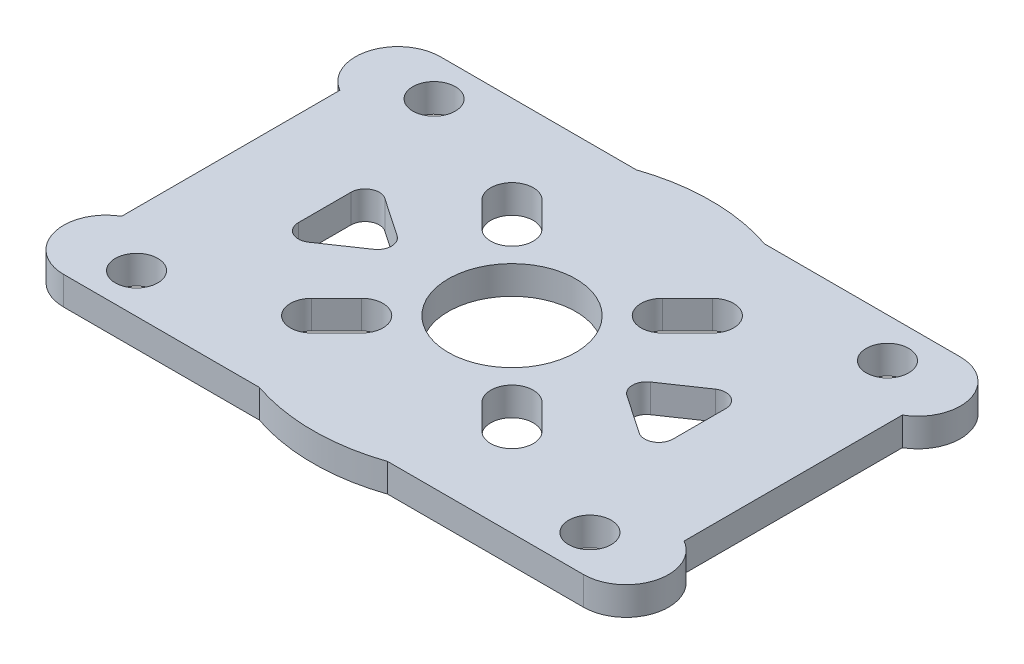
ISO-10303-21;
HEADER;
FILE_DESCRIPTION(('STEP AP214'),'2;1');
FILE_NAME('part.step','',(''),(''),'','','');
FILE_SCHEMA(('AUTOMOTIVE_DESIGN { 1 0 10303 214 1 1 1 1 }'));
ENDSEC;
DATA;
#1=APPLICATION_CONTEXT('core data for automotive mechanical design processes');
#2=APPLICATION_PROTOCOL_DEFINITION('international standard','automotive_design',2000,#1);
#3=PRODUCT_CONTEXT('',#1,'mechanical');
#4=PRODUCT('Part','Part','',(#3));
#5=PRODUCT_RELATED_PRODUCT_CATEGORY('part','',(#4));
#6=PRODUCT_DEFINITION_FORMATION('','',#4);
#7=PRODUCT_DEFINITION_CONTEXT('part definition',#1,'design');
#8=PRODUCT_DEFINITION('design','',#6,#7);
#9=PRODUCT_DEFINITION_SHAPE('','',#8);
#10=(LENGTH_UNIT() NAMED_UNIT(*) SI_UNIT(.MILLI.,.METRE.));
#11=(NAMED_UNIT(*) PLANE_ANGLE_UNIT() SI_UNIT($,.RADIAN.));
#12=(NAMED_UNIT(*) SI_UNIT($,.STERADIAN.) SOLID_ANGLE_UNIT());
#13=UNCERTAINTY_MEASURE_WITH_UNIT(LENGTH_MEASURE(1.E-05),#10,'distance_accuracy_value','');
#14=(GEOMETRIC_REPRESENTATION_CONTEXT(3) GLOBAL_UNCERTAINTY_ASSIGNED_CONTEXT((#13)) GLOBAL_UNIT_ASSIGNED_CONTEXT((#10,
#11,#12)) REPRESENTATION_CONTEXT('',''));
#15=CARTESIAN_POINT('',(0.,0.,0.));
#16=DIRECTION('',(0.,0.,1.));
#17=DIRECTION('',(1.,0.,0.));
#18=AXIS2_PLACEMENT_3D('',#15,#16,#17);
#19=CARTESIAN_POINT('',(-18.35,2.,10.3));
#20=DIRECTION('',(0.,1.,0.));
#21=DIRECTION('',(0.,0.,1.));
#22=AXIS2_PLACEMENT_3D('',#19,#20,#21);
#23=PLANE('',#22);
#24=CARTESIAN_POINT('',(16.,2.,-10.5));
#25=DIRECTION('',(0.,1.,0.));
#26=DIRECTION('',(0.,0.,1.));
#27=AXIS2_PLACEMENT_3D('',#24,#25,#26);
#28=CIRCLE('',#27,1.5);
#29=CARTESIAN_POINT('',(16.,2.,-9.));
#30=VERTEX_POINT('',#29);
#31=EDGE_CURVE('E522',#30,#30,#28,.T.);
#32=ORIENTED_EDGE('',*,*,#31,.F.);
#33=EDGE_LOOP('',(#32));
#34=FACE_BOUND('',#33,.T.);
#35=CARTESIAN_POINT('',(-16.,2.,10.5));
#36=DIRECTION('',(0.,1.,0.));
#37=DIRECTION('',(0.,0.,1.));
#38=AXIS2_PLACEMENT_3D('',#35,#36,#37);
#39=CIRCLE('',#38,1.5);
#40=CARTESIAN_POINT('',(-16.,2.,12.));
#41=VERTEX_POINT('',#40);
#42=EDGE_CURVE('E534',#41,#41,#39,.T.);
#43=ORIENTED_EDGE('',*,*,#42,.F.);
#44=EDGE_LOOP('',(#43));
#45=FACE_BOUND('',#44,.T.);
#46=CARTESIAN_POINT('',(-18.35,2.,10.3));
#47=DIRECTION('',(0.,1.,0.));
#48=DIRECTION('',(0.,0.,1.));
#49=AXIS2_PLACEMENT_3D('',#46,#47,#48);
#50=CIRCLE('',#49,3.);
#51=CARTESIAN_POINT('',(-19.85,2.,7.70192378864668));
#52=VERTEX_POINT('',#51);
#53=CARTESIAN_POINT('',(-18.35,2.,13.3));
#54=VERTEX_POINT('',#53);
#55=EDGE_CURVE('E546',#52,#54,#50,.T.);
#56=ORIENTED_EDGE('',*,*,#55,.T.);
#57=DIRECTION('',(1.,0.,0.));
#58=VECTOR('',#57,1.);
#59=CARTESIAN_POINT('',(-18.35,2.,13.3));
#60=LINE('',#59,#58);
#61=CARTESIAN_POINT('',(-4.52907275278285,2.,13.3));
#62=VERTEX_POINT('',#61);
#63=EDGE_CURVE('E549',#54,#62,#60,.T.);
#64=ORIENTED_EDGE('',*,*,#63,.T.);
#65=CARTESIAN_POINT('',(0.,2.,0.));
#66=DIRECTION('',(0.,1.,0.));
#67=DIRECTION('',(0.,0.,1.));
#68=AXIS2_PLACEMENT_3D('',#65,#66,#67);
#69=CIRCLE('',#68,14.05);
#70=CARTESIAN_POINT('',(4.52907275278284,2.,13.3));
#71=VERTEX_POINT('',#70);
#72=EDGE_CURVE('E552',#62,#71,#69,.T.);
#73=ORIENTED_EDGE('',*,*,#72,.T.);
#74=DIRECTION('',(1.,0.,0.));
#75=VECTOR('',#74,1.);
#76=CARTESIAN_POINT('',(4.52907275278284,2.,13.3));
#77=LINE('',#76,#75);
#78=CARTESIAN_POINT('',(18.35,2.,13.3));
#79=VERTEX_POINT('',#78);
#80=EDGE_CURVE('E554',#71,#79,#77,.T.);
#81=ORIENTED_EDGE('',*,*,#80,.T.);
#82=CARTESIAN_POINT('',(18.35,2.,10.3));
#83=DIRECTION('',(0.,1.,0.));
#84=DIRECTION('',(0.,0.,1.));
#85=AXIS2_PLACEMENT_3D('',#82,#83,#84);
#86=CIRCLE('',#85,3.);
#87=CARTESIAN_POINT('',(19.85,2.,7.70192378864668));
#88=VERTEX_POINT('',#87);
#89=EDGE_CURVE('E556',#79,#88,#86,.T.);
#90=ORIENTED_EDGE('',*,*,#89,.T.);
#91=DIRECTION('',(0.,0.,-1.));
#92=VECTOR('',#91,1.);
#93=CARTESIAN_POINT('',(19.85,2.,-7.70192378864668));
#94=LINE('',#93,#92);
#95=CARTESIAN_POINT('',(19.85,2.,-7.70192378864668));
#96=VERTEX_POINT('',#95);
#97=EDGE_CURVE('E558',#88,#96,#94,.T.);
#98=ORIENTED_EDGE('',*,*,#97,.T.);
#99=CARTESIAN_POINT('',(18.35,2.,-10.3));
#100=DIRECTION('',(0.,1.,0.));
#101=DIRECTION('',(0.,0.,1.));
#102=AXIS2_PLACEMENT_3D('',#99,#100,#101);
#103=CIRCLE('',#102,3.);
#104=CARTESIAN_POINT('',(18.35,2.,-13.3));
#105=VERTEX_POINT('',#104);
#106=EDGE_CURVE('E560',#96,#105,#103,.T.);
#107=ORIENTED_EDGE('',*,*,#106,.T.);
#108=DIRECTION('',(-1.,0.,0.));
#109=VECTOR('',#108,1.);
#110=CARTESIAN_POINT('',(4.52907275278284,2.,-13.3));
#111=LINE('',#110,#109);
#112=CARTESIAN_POINT('',(4.52907275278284,2.,-13.3));
#113=VERTEX_POINT('',#112);
#114=EDGE_CURVE('E562',#105,#113,#111,.T.);
#115=ORIENTED_EDGE('',*,*,#114,.T.);
#116=CARTESIAN_POINT('',(0.,2.,0.));
#117=DIRECTION('',(0.,1.,0.));
#118=DIRECTION('',(0.,0.,1.));
#119=AXIS2_PLACEMENT_3D('',#116,#117,#118);
#120=CIRCLE('',#119,14.05);
#121=CARTESIAN_POINT('',(-4.52907275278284,2.,-13.3));
#122=VERTEX_POINT('',#121);
#123=EDGE_CURVE('E564',#113,#122,#120,.T.);
#124=ORIENTED_EDGE('',*,*,#123,.T.);
#125=DIRECTION('',(-1.,0.,0.));
#126=VECTOR('',#125,1.);
#127=CARTESIAN_POINT('',(-18.35,2.,-13.3));
#128=LINE('',#127,#126);
#129=CARTESIAN_POINT('',(-18.35,2.,-13.3));
#130=VERTEX_POINT('',#129);
#131=EDGE_CURVE('E566',#122,#130,#128,.T.);
#132=ORIENTED_EDGE('',*,*,#131,.T.);
#133=CARTESIAN_POINT('',(-18.35,2.,-10.3));
#134=DIRECTION('',(0.,1.,0.));
#135=DIRECTION('',(0.,0.,1.));
#136=AXIS2_PLACEMENT_3D('',#133,#134,#135);
#137=CIRCLE('',#136,3.);
#138=CARTESIAN_POINT('',(-19.85,2.,-7.70192378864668));
#139=VERTEX_POINT('',#138);
#140=EDGE_CURVE('E568',#130,#139,#137,.T.);
#141=ORIENTED_EDGE('',*,*,#140,.T.);
#142=DIRECTION('',(0.,0.,1.));
#143=VECTOR('',#142,1.);
#144=CARTESIAN_POINT('',(-19.85,2.,-7.70192378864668));
#145=LINE('',#144,#143);
#146=EDGE_CURVE('E570',#139,#52,#145,.T.);
#147=ORIENTED_EDGE('',*,*,#146,.T.);
#148=EDGE_LOOP('',(#56,#64,#73,#81,#90,#98,#107,#115,#124,#132,#141,#147));
#149=FACE_BOUND('',#148,.T.);
#150=CARTESIAN_POINT('',(-16.,2.,-10.5));
#151=DIRECTION('',(0.,1.,0.));
#152=DIRECTION('',(0.,0.,1.));
#153=AXIS2_PLACEMENT_3D('',#150,#151,#152);
#154=CIRCLE('',#153,1.5);
#155=CARTESIAN_POINT('',(-16.,2.,-9.00000000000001));
#156=VERTEX_POINT('',#155);
#157=EDGE_CURVE('E540',#156,#156,#154,.T.);
#158=ORIENTED_EDGE('',*,*,#157,.F.);
#159=EDGE_LOOP('',(#158));
#160=FACE_BOUND('',#159,.T.);
#161=CARTESIAN_POINT('',(16.,2.,10.5));
#162=DIRECTION('',(0.,1.,0.));
#163=DIRECTION('',(0.,0.,1.));
#164=AXIS2_PLACEMENT_3D('',#161,#162,#163);
#165=CIRCLE('',#164,1.5);
#166=CARTESIAN_POINT('',(16.,2.,12.));
#167=VERTEX_POINT('',#166);
#168=EDGE_CURVE('E528',#167,#167,#165,.T.);
#169=ORIENTED_EDGE('',*,*,#168,.F.);
#170=EDGE_LOOP('',(#169));
#171=FACE_BOUND('',#170,.T.);
#172=CARTESIAN_POINT('',(0.,2.,0.));
#173=DIRECTION('',(0.,1.,0.));
#174=DIRECTION('',(0.,0.,1.));
#175=AXIS2_PLACEMENT_3D('',#172,#173,#174);
#176=CIRCLE('',#175,4.5);
#177=CARTESIAN_POINT('',(0.,2.,4.5));
#178=VERTEX_POINT('',#177);
#179=EDGE_CURVE('E516',#178,#178,#176,.T.);
#180=ORIENTED_EDGE('',*,*,#179,.F.);
#181=EDGE_LOOP('',(#180));
#182=FACE_BOUND('',#181,.T.);
#183=DIRECTION('',(0.707106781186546,0.,0.707106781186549));
#184=VECTOR('',#183,1.);
#185=CARTESIAN_POINT('',(-8.13172798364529,2.,-6.01040764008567));
#186=LINE('',#185,#184);
#187=CARTESIAN_POINT('',(-8.13172798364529,2.,-6.01040764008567));
#188=VERTEX_POINT('',#187);
#189=CARTESIAN_POINT('',(-6.36396103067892,2.,-4.24264068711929));
#190=VERTEX_POINT('',#189);
#191=EDGE_CURVE('E487',#188,#190,#186,.T.);
#192=ORIENTED_EDGE('',*,*,#191,.F.);
#193=CARTESIAN_POINT('',(-7.07106781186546,2.,-7.07106781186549));
#194=DIRECTION('',(0.,1.,0.));
#195=DIRECTION('',(0.,0.,1.));
#196=AXIS2_PLACEMENT_3D('',#193,#194,#195);
#197=CIRCLE('',#196,1.5);
#198=CARTESIAN_POINT('',(-6.01040764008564,2.,-8.13172798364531));
#199=VERTEX_POINT('',#198);
#200=EDGE_CURVE('E485',#199,#188,#197,.T.);
#201=ORIENTED_EDGE('',*,*,#200,.F.);
#202=DIRECTION('',(-0.707106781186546,0.,-0.707106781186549));
#203=VECTOR('',#202,1.);
#204=CARTESIAN_POINT('',(-6.01040764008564,2.,-8.13172798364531));
#205=LINE('',#204,#203);
#206=CARTESIAN_POINT('',(-4.24264068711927,2.,-6.36396103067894));
#207=VERTEX_POINT('',#206);
#208=EDGE_CURVE('E493',#207,#199,#205,.T.);
#209=ORIENTED_EDGE('',*,*,#208,.F.);
#210=CARTESIAN_POINT('',(-5.3033008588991,2.,-5.30330085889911));
#211=DIRECTION('',(0.,1.,0.));
#212=DIRECTION('',(0.,0.,1.));
#213=AXIS2_PLACEMENT_3D('',#210,#211,#212);
#214=CIRCLE('',#213,1.5);
#215=EDGE_CURVE('E490',#190,#207,#214,.T.);
#216=ORIENTED_EDGE('',*,*,#215,.F.);
#217=EDGE_LOOP('',(#192,#201,#209,#216));
#218=FACE_BOUND('',#217,.T.);
#219=DIRECTION('',(-0.707106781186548,0.,0.707106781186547));
#220=VECTOR('',#219,1.);
#221=CARTESIAN_POINT('',(6.01040764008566,2.,-8.13172798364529));
#222=LINE('',#221,#220);
#223=CARTESIAN_POINT('',(6.01040764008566,2.,-8.13172798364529));
#224=VERTEX_POINT('',#223);
#225=CARTESIAN_POINT('',(4.24264068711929,2.,-6.36396103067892));
#226=VERTEX_POINT('',#225);
#227=EDGE_CURVE('E456',#224,#226,#222,.T.);
#228=ORIENTED_EDGE('',*,*,#227,.F.);
#229=CARTESIAN_POINT('',(7.07106781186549,2.,-7.07106781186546));
#230=DIRECTION('',(0.,1.,0.));
#231=DIRECTION('',(0.,0.,1.));
#232=AXIS2_PLACEMENT_3D('',#229,#230,#231);
#233=CIRCLE('',#232,1.5);
#234=CARTESIAN_POINT('',(8.1317279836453,2.,-6.01040764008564));
#235=VERTEX_POINT('',#234);
#236=EDGE_CURVE('E454',#235,#224,#233,.T.);
#237=ORIENTED_EDGE('',*,*,#236,.F.);
#238=DIRECTION('',(0.707106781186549,0.,-0.707106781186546));
#239=VECTOR('',#238,1.);
#240=CARTESIAN_POINT('',(8.1317279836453,2.,-6.01040764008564));
#241=LINE('',#240,#239);
#242=CARTESIAN_POINT('',(6.36396103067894,2.,-4.24264068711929));
#243=VERTEX_POINT('',#242);
#244=EDGE_CURVE('E462',#243,#235,#241,.T.);
#245=ORIENTED_EDGE('',*,*,#244,.F.);
#246=CARTESIAN_POINT('',(5.30330085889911,2.,-5.3033008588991));
#247=DIRECTION('',(0.,1.,0.));
#248=DIRECTION('',(0.,0.,1.));
#249=AXIS2_PLACEMENT_3D('',#246,#247,#248);
#250=CIRCLE('',#249,1.5);
#251=EDGE_CURVE('E459',#226,#243,#250,.T.);
#252=ORIENTED_EDGE('',*,*,#251,.F.);
#253=EDGE_LOOP('',(#228,#237,#245,#252));
#254=FACE_BOUND('',#253,.T.);
#255=DIRECTION('',(-0.707106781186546,0.,-0.70710678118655));
#256=VECTOR('',#255,1.);
#257=CARTESIAN_POINT('',(8.13172798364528,2.,6.01040764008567));
#258=LINE('',#257,#256);
#259=CARTESIAN_POINT('',(8.13172798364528,2.,6.01040764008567));
#260=VERTEX_POINT('',#259);
#261=CARTESIAN_POINT('',(6.36396103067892,2.,4.2426406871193));
#262=VERTEX_POINT('',#261);
#263=EDGE_CURVE('E425',#260,#262,#258,.T.);
#264=ORIENTED_EDGE('',*,*,#263,.F.);
#265=CARTESIAN_POINT('',(7.07106781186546,2.,7.07106781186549));
#266=DIRECTION('',(0.,1.,0.));
#267=DIRECTION('',(0.,0.,1.));
#268=AXIS2_PLACEMENT_3D('',#265,#266,#267);
#269=CIRCLE('',#268,1.49999999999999);
#270=CARTESIAN_POINT('',(6.01040764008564,2.,8.1317279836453));
#271=VERTEX_POINT('',#270);
#272=EDGE_CURVE('E423',#271,#260,#269,.T.);
#273=ORIENTED_EDGE('',*,*,#272,.F.);
#274=DIRECTION('',(0.707106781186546,0.,0.707106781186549));
#275=VECTOR('',#274,1.);
#276=CARTESIAN_POINT('',(6.01040764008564,2.,8.1317279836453));
#277=LINE('',#276,#275);
#278=CARTESIAN_POINT('',(4.24264068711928,2.,6.36396103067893));
#279=VERTEX_POINT('',#278);
#280=EDGE_CURVE('E431',#279,#271,#277,.T.);
#281=ORIENTED_EDGE('',*,*,#280,.F.);
#282=CARTESIAN_POINT('',(5.3033008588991,2.,5.30330085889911));
#283=DIRECTION('',(0.,1.,0.));
#284=DIRECTION('',(0.,0.,1.));
#285=AXIS2_PLACEMENT_3D('',#282,#283,#284);
#286=CIRCLE('',#285,1.5);
#287=EDGE_CURVE('E428',#262,#279,#286,.T.);
#288=ORIENTED_EDGE('',*,*,#287,.F.);
#289=EDGE_LOOP('',(#264,#273,#281,#288));
#290=FACE_BOUND('',#289,.T.);
#291=DIRECTION('',(0.707106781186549,0.,-0.707106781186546));
#292=VECTOR('',#291,1.);
#293=CARTESIAN_POINT('',(-6.01040764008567,2.,8.13172798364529));
#294=LINE('',#293,#292);
#295=CARTESIAN_POINT('',(-6.01040764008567,2.,8.13172798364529));
#296=VERTEX_POINT('',#295);
#297=CARTESIAN_POINT('',(-4.2426406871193,2.,6.36396103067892));
#298=VERTEX_POINT('',#297);
#299=EDGE_CURVE('E394',#296,#298,#294,.T.);
#300=ORIENTED_EDGE('',*,*,#299,.F.);
#301=CARTESIAN_POINT('',(-7.07106781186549,2.,7.07106781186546));
#302=DIRECTION('',(0.,1.,0.));
#303=DIRECTION('',(0.,0.,1.));
#304=AXIS2_PLACEMENT_3D('',#301,#302,#303);
#305=CIRCLE('',#304,1.5);
#306=CARTESIAN_POINT('',(-8.1317279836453,2.,6.01040764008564));
#307=VERTEX_POINT('',#306);
#308=EDGE_CURVE('E392',#307,#296,#305,.T.);
#309=ORIENTED_EDGE('',*,*,#308,.F.);
#310=DIRECTION('',(-0.707106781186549,0.,0.707106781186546));
#311=VECTOR('',#310,1.);
#312=CARTESIAN_POINT('',(-8.1317279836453,2.,6.01040764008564));
#313=LINE('',#312,#311);
#314=CARTESIAN_POINT('',(-6.36396103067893,2.,4.24264068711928));
#315=VERTEX_POINT('',#314);
#316=EDGE_CURVE('E400',#315,#307,#313,.T.);
#317=ORIENTED_EDGE('',*,*,#316,.F.);
#318=CARTESIAN_POINT('',(-5.30330085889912,2.,5.3033008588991));
#319=DIRECTION('',(0.,1.,0.));
#320=DIRECTION('',(0.,0.,1.));
#321=AXIS2_PLACEMENT_3D('',#318,#319,#320);
#322=CIRCLE('',#321,1.5);
#323=EDGE_CURVE('E397',#298,#315,#322,.T.);
#324=ORIENTED_EDGE('',*,*,#323,.F.);
#325=EDGE_LOOP('',(#300,#309,#317,#324));
#326=FACE_BOUND('',#325,.T.);
#327=DIRECTION('',(-0.826227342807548,0.,-0.56333682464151));
#328=VECTOR('',#327,1.);
#329=CARTESIAN_POINT('',(-8.93666317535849,2.,-0.826227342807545));
#330=LINE('',#329,#328);
#331=CARTESIAN_POINT('',(-8.93666317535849,2.,-0.826227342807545));
#332=VERTEX_POINT('',#331);
#333=CARTESIAN_POINT('',(-11.6615262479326,2.,-2.68408852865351));
#334=VERTEX_POINT('',#333);
#335=EDGE_CURVE('E349',#332,#334,#330,.T.);
#336=ORIENTED_EDGE('',*,*,#335,.F.);
#337=CARTESIAN_POINT('',(-9.5,2.,0.));
#338=DIRECTION('',(0.,1.,0.));
#339=DIRECTION('',(0.,0.,-1.));
#340=AXIS2_PLACEMENT_3D('',#337,#338,#339);
#341=CIRCLE('',#340,0.999999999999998);
#342=CARTESIAN_POINT('',(-8.93666317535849,2.,0.826227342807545));
#343=VERTEX_POINT('',#342);
#344=EDGE_CURVE('E347',#343,#332,#341,.T.);
#345=ORIENTED_EDGE('',*,*,#344,.F.);
#346=DIRECTION('',(0.826227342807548,0.,-0.56333682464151));
#347=VECTOR('',#346,1.);
#348=CARTESIAN_POINT('',(-11.6615262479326,2.,2.68408852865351));
#349=LINE('',#348,#347);
#350=CARTESIAN_POINT('',(-11.6615262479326,2.,2.68408852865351));
#351=VERTEX_POINT('',#350);
#352=EDGE_CURVE('E359',#351,#343,#349,.T.);
#353=ORIENTED_EDGE('',*,*,#352,.F.);
#354=CARTESIAN_POINT('',(-12.2248630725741,2.,1.85786118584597));
#355=DIRECTION('',(0.,1.,0.));
#356=DIRECTION('',(0.,0.,-1.));
#357=AXIS2_PLACEMENT_3D('',#354,#355,#356);
#358=CIRCLE('',#357,0.999999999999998);
#359=CARTESIAN_POINT('',(-13.2248630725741,2.,1.85786118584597));
#360=VERTEX_POINT('',#359);
#361=EDGE_CURVE('E356',#360,#351,#358,.T.);
#362=ORIENTED_EDGE('',*,*,#361,.F.);
#363=DIRECTION('',(0.,0.,1.));
#364=VECTOR('',#363,1.);
#365=CARTESIAN_POINT('',(-13.2248630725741,2.,-1.85786118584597));
#366=LINE('',#365,#364);
#367=CARTESIAN_POINT('',(-13.2248630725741,2.,-1.85786118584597));
#368=VERTEX_POINT('',#367);
#369=EDGE_CURVE('E354',#368,#360,#366,.T.);
#370=ORIENTED_EDGE('',*,*,#369,.F.);
#371=CARTESIAN_POINT('',(-12.2248630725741,2.,-1.85786118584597));
#372=DIRECTION('',(0.,1.,0.));
#373=DIRECTION('',(0.,0.,1.));
#374=AXIS2_PLACEMENT_3D('',#371,#372,#373);
#375=CIRCLE('',#374,0.999999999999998);
#376=EDGE_CURVE('E352',#334,#368,#375,.T.);
#377=ORIENTED_EDGE('',*,*,#376,.F.);
#378=EDGE_LOOP('',(#336,#345,#353,#362,#370,#377));
#379=FACE_BOUND('',#378,.T.);
#380=DIRECTION('',(0.,0.,-1.));
#381=VECTOR('',#380,1.);
#382=CARTESIAN_POINT('',(13.2248630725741,2.,-1.85786118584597));
#383=LINE('',#382,#381);
#384=CARTESIAN_POINT('',(13.2248630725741,2.,1.85786118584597));
#385=VERTEX_POINT('',#384);
#386=CARTESIAN_POINT('',(13.2248630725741,2.,-1.85786118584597));
#387=VERTEX_POINT('',#386);
#388=EDGE_CURVE('E304',#385,#387,#383,.T.);
#389=ORIENTED_EDGE('',*,*,#388,.F.);
#390=CARTESIAN_POINT('',(12.2248630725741,2.,1.85786118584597));
#391=DIRECTION('',(0.,1.,0.));
#392=DIRECTION('',(0.,0.,1.));
#393=AXIS2_PLACEMENT_3D('',#390,#391,#392);
#394=CIRCLE('',#393,0.999999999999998);
#395=CARTESIAN_POINT('',(11.6615262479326,2.,2.68408852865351));
#396=VERTEX_POINT('',#395);
#397=EDGE_CURVE('E296',#396,#385,#394,.T.);
#398=ORIENTED_EDGE('',*,*,#397,.F.);
#399=DIRECTION('',(0.826227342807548,0.,0.56333682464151));
#400=VECTOR('',#399,1.);
#401=CARTESIAN_POINT('',(11.6615262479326,2.,2.68408852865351));
#402=LINE('',#401,#400);
#403=CARTESIAN_POINT('',(8.93666317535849,2.,0.826227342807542));
#404=VERTEX_POINT('',#403);
#405=EDGE_CURVE('E325',#404,#396,#402,.T.);
#406=ORIENTED_EDGE('',*,*,#405,.F.);
#407=CARTESIAN_POINT('',(9.5,2.,0.));
#408=DIRECTION('',(0.,1.,0.));
#409=DIRECTION('',(0.,0.,1.));
#410=AXIS2_PLACEMENT_3D('',#407,#408,#409);
#411=CIRCLE('',#410,0.999999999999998);
#412=CARTESIAN_POINT('',(8.93666317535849,2.,-0.826227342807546));
#413=VERTEX_POINT('',#412);
#414=EDGE_CURVE('E323',#413,#404,#411,.T.);
#415=ORIENTED_EDGE('',*,*,#414,.F.);
#416=DIRECTION('',(-0.826227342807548,0.,0.56333682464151));
#417=VECTOR('',#416,1.);
#418=CARTESIAN_POINT('',(8.93666317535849,2.,-0.826227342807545));
#419=LINE('',#418,#417);
#420=CARTESIAN_POINT('',(11.6615262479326,2.,-2.68408852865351));
#421=VERTEX_POINT('',#420);
#422=EDGE_CURVE('E319',#421,#413,#419,.T.);
#423=ORIENTED_EDGE('',*,*,#422,.F.);
#424=CARTESIAN_POINT('',(12.2248630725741,2.,-1.85786118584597));
#425=DIRECTION('',(0.,1.,0.));
#426=DIRECTION('',(0.,0.,-1.));
#427=AXIS2_PLACEMENT_3D('',#424,#425,#426);
#428=CIRCLE('',#427,0.999999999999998);
#429=EDGE_CURVE('E317',#387,#421,#428,.T.);
#430=ORIENTED_EDGE('',*,*,#429,.F.);
#431=EDGE_LOOP('',(#389,#398,#406,#415,#423,#430));
#432=FACE_BOUND('',#431,.T.);
#433=ADVANCED_FACE('F39',(#34,#45,#149,#160,#171,#182,#218,#254,#290,#326,#379,#432),#23,.T.);
#434=CARTESIAN_POINT('',(-18.35,0.,10.3));
#435=DIRECTION('',(0.,1.,0.));
#436=DIRECTION('',(0.,0.,1.));
#437=AXIS2_PLACEMENT_3D('',#434,#435,#436);
#438=PLANE('',#437);
#439=CARTESIAN_POINT('',(-9.5,0.,0.));
#440=DIRECTION('',(0.,1.,0.));
#441=DIRECTION('',(0.,0.,-1.));
#442=AXIS2_PLACEMENT_3D('',#439,#440,#441);
#443=CIRCLE('',#442,0.999999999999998);
#444=CARTESIAN_POINT('',(-8.93666317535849,0.,0.826227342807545));
#445=VERTEX_POINT('',#444);
#446=CARTESIAN_POINT('',(-8.93666317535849,0.,-0.826227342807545));
#447=VERTEX_POINT('',#446);
#448=EDGE_CURVE('E312',#445,#447,#443,.T.);
#449=ORIENTED_EDGE('',*,*,#448,.T.);
#450=DIRECTION('',(-0.826227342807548,0.,-0.56333682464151));
#451=VECTOR('',#450,1.);
#452=CARTESIAN_POINT('',(-8.93666317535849,0.,-0.826227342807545));
#453=LINE('',#452,#451);
#454=CARTESIAN_POINT('',(-11.6615262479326,0.,-2.68408852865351));
#455=VERTEX_POINT('',#454);
#456=EDGE_CURVE('E364',#447,#455,#453,.T.);
#457=ORIENTED_EDGE('',*,*,#456,.T.);
#458=CARTESIAN_POINT('',(-12.2248630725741,0.,-1.85786118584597));
#459=DIRECTION('',(0.,1.,0.));
#460=DIRECTION('',(0.,0.,1.));
#461=AXIS2_PLACEMENT_3D('',#458,#459,#460);
#462=CIRCLE('',#461,0.999999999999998);
#463=CARTESIAN_POINT('',(-13.2248630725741,0.,-1.85786118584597));
#464=VERTEX_POINT('',#463);
#465=EDGE_CURVE('E367',#455,#464,#462,.T.);
#466=ORIENTED_EDGE('',*,*,#465,.T.);
#467=DIRECTION('',(0.,0.,1.));
#468=VECTOR('',#467,1.);
#469=CARTESIAN_POINT('',(-13.2248630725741,0.,-1.85786118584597));
#470=LINE('',#469,#468);
#471=CARTESIAN_POINT('',(-13.2248630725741,0.,1.85786118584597));
#472=VERTEX_POINT('',#471);
#473=EDGE_CURVE('E370',#464,#472,#470,.T.);
#474=ORIENTED_EDGE('',*,*,#473,.T.);
#475=CARTESIAN_POINT('',(-12.2248630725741,0.,1.85786118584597));
#476=DIRECTION('',(0.,1.,0.));
#477=DIRECTION('',(0.,0.,-1.));
#478=AXIS2_PLACEMENT_3D('',#475,#476,#477);
#479=CIRCLE('',#478,0.999999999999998);
#480=CARTESIAN_POINT('',(-11.6615262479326,0.,2.68408852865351));
#481=VERTEX_POINT('',#480);
#482=EDGE_CURVE('E373',#472,#481,#479,.T.);
#483=ORIENTED_EDGE('',*,*,#482,.T.);
#484=DIRECTION('',(0.826227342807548,0.,-0.56333682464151));
#485=VECTOR('',#484,1.);
#486=CARTESIAN_POINT('',(-11.6615262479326,0.,2.68408852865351));
#487=LINE('',#486,#485);
#488=EDGE_CURVE('E350',#481,#445,#487,.T.);
#489=ORIENTED_EDGE('',*,*,#488,.T.);
#490=EDGE_LOOP('',(#449,#457,#466,#474,#483,#489));
#491=FACE_BOUND('',#490,.T.);
#492=CARTESIAN_POINT('',(7.07106781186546,0.,7.07106781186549));
#493=DIRECTION('',(0.,1.,0.));
#494=DIRECTION('',(0.,0.,1.));
#495=AXIS2_PLACEMENT_3D('',#492,#493,#494);
#496=CIRCLE('',#495,1.49999999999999);
#497=CARTESIAN_POINT('',(6.01040764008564,0.,8.1317279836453));
#498=VERTEX_POINT('',#497);
#499=CARTESIAN_POINT('',(8.13172798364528,0.,6.01040764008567));
#500=VERTEX_POINT('',#499);
#501=EDGE_CURVE('E422',#498,#500,#496,.T.);
#502=ORIENTED_EDGE('',*,*,#501,.T.);
#503=DIRECTION('',(-0.707106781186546,0.,-0.70710678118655));
#504=VECTOR('',#503,1.);
#505=CARTESIAN_POINT('',(8.13172798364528,0.,6.01040764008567));
#506=LINE('',#505,#504);
#507=CARTESIAN_POINT('',(6.36396103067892,0.,4.2426406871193));
#508=VERTEX_POINT('',#507);
#509=EDGE_CURVE('E436',#500,#508,#506,.T.);
#510=ORIENTED_EDGE('',*,*,#509,.T.);
#511=CARTESIAN_POINT('',(5.3033008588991,0.,5.30330085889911));
#512=DIRECTION('',(0.,1.,0.));
#513=DIRECTION('',(0.,0.,1.));
#514=AXIS2_PLACEMENT_3D('',#511,#512,#513);
#515=CIRCLE('',#514,1.5);
#516=CARTESIAN_POINT('',(4.24264068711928,0.,6.36396103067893));
#517=VERTEX_POINT('',#516);
#518=EDGE_CURVE('E439',#508,#517,#515,.T.);
#519=ORIENTED_EDGE('',*,*,#518,.T.);
#520=DIRECTION('',(0.707106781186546,0.,0.707106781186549));
#521=VECTOR('',#520,1.);
#522=CARTESIAN_POINT('',(6.01040764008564,0.,8.1317279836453));
#523=LINE('',#522,#521);
#524=EDGE_CURVE('E426',#517,#498,#523,.T.);
#525=ORIENTED_EDGE('',*,*,#524,.T.);
#526=EDGE_LOOP('',(#502,#510,#519,#525));
#527=FACE_BOUND('',#526,.T.);
#528=CARTESIAN_POINT('',(-7.07106781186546,0.,-7.07106781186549));
#529=DIRECTION('',(0.,1.,0.));
#530=DIRECTION('',(0.,0.,1.));
#531=AXIS2_PLACEMENT_3D('',#528,#529,#530);
#532=CIRCLE('',#531,1.5);
#533=CARTESIAN_POINT('',(-6.01040764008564,0.,-8.13172798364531));
#534=VERTEX_POINT('',#533);
#535=CARTESIAN_POINT('',(-8.13172798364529,0.,-6.01040764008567));
#536=VERTEX_POINT('',#535);
#537=EDGE_CURVE('E484',#534,#536,#532,.T.);
#538=ORIENTED_EDGE('',*,*,#537,.T.);
#539=DIRECTION('',(0.707106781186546,0.,0.707106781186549));
#540=VECTOR('',#539,1.);
#541=CARTESIAN_POINT('',(-8.13172798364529,0.,-6.01040764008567));
#542=LINE('',#541,#540);
#543=CARTESIAN_POINT('',(-6.36396103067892,0.,-4.24264068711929));
#544=VERTEX_POINT('',#543);
#545=EDGE_CURVE('E498',#536,#544,#542,.T.);
#546=ORIENTED_EDGE('',*,*,#545,.T.);
#547=CARTESIAN_POINT('',(-5.3033008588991,0.,-5.30330085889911));
#548=DIRECTION('',(0.,1.,0.));
#549=DIRECTION('',(0.,0.,1.));
#550=AXIS2_PLACEMENT_3D('',#547,#548,#549);
#551=CIRCLE('',#550,1.5);
#552=CARTESIAN_POINT('',(-4.24264068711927,0.,-6.36396103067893));
#553=VERTEX_POINT('',#552);
#554=EDGE_CURVE('E501',#544,#553,#551,.T.);
#555=ORIENTED_EDGE('',*,*,#554,.T.);
#556=DIRECTION('',(-0.707106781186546,0.,-0.707106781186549));
#557=VECTOR('',#556,1.);
#558=CARTESIAN_POINT('',(-6.01040764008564,0.,-8.13172798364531));
#559=LINE('',#558,#557);
#560=EDGE_CURVE('E488',#553,#534,#559,.T.);
#561=ORIENTED_EDGE('',*,*,#560,.T.);
#562=EDGE_LOOP('',(#538,#546,#555,#561));
#563=FACE_BOUND('',#562,.T.);
#564=CARTESIAN_POINT('',(-18.35,0.,10.3));
#565=DIRECTION('',(0.,1.,0.));
#566=DIRECTION('',(0.,0.,1.));
#567=AXIS2_PLACEMENT_3D('',#564,#565,#566);
#568=CIRCLE('',#567,3.);
#569=CARTESIAN_POINT('',(-19.85,0.,7.70192378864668));
#570=VERTEX_POINT('',#569);
#571=CARTESIAN_POINT('',(-18.35,0.,13.3));
#572=VERTEX_POINT('',#571);
#573=EDGE_CURVE('E543',#570,#572,#568,.T.);
#574=ORIENTED_EDGE('',*,*,#573,.F.);
#575=DIRECTION('',(0.,0.,1.));
#576=VECTOR('',#575,1.);
#577=CARTESIAN_POINT('',(-19.85,0.,-7.70192378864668));
#578=LINE('',#577,#576);
#579=CARTESIAN_POINT('',(-19.85,0.,-7.70192378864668));
#580=VERTEX_POINT('',#579);
#581=EDGE_CURVE('E550',#580,#570,#578,.T.);
#582=ORIENTED_EDGE('',*,*,#581,.F.);
#583=CARTESIAN_POINT('',(-18.35,0.,-10.3));
#584=DIRECTION('',(0.,1.,0.));
#585=DIRECTION('',(0.,0.,1.));
#586=AXIS2_PLACEMENT_3D('',#583,#584,#585);
#587=CIRCLE('',#586,3.);
#588=CARTESIAN_POINT('',(-18.35,0.,-13.3));
#589=VERTEX_POINT('',#588);
#590=EDGE_CURVE('E593',#589,#580,#587,.T.);
#591=ORIENTED_EDGE('',*,*,#590,.F.);
#592=DIRECTION('',(-1.,0.,0.));
#593=VECTOR('',#592,1.);
#594=CARTESIAN_POINT('',(-18.35,0.,-13.3));
#595=LINE('',#594,#593);
#596=CARTESIAN_POINT('',(-4.52907275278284,0.,-13.3));
#597=VERTEX_POINT('',#596);
#598=EDGE_CURVE('E591',#597,#589,#595,.T.);
#599=ORIENTED_EDGE('',*,*,#598,.F.);
#600=CARTESIAN_POINT('',(0.,0.,0.));
#601=DIRECTION('',(0.,1.,0.));
#602=DIRECTION('',(0.,0.,1.));
#603=AXIS2_PLACEMENT_3D('',#600,#601,#602);
#604=CIRCLE('',#603,14.05);
#605=CARTESIAN_POINT('',(4.52907275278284,0.,-13.3));
#606=VERTEX_POINT('',#605);
#607=EDGE_CURVE('E589',#606,#597,#604,.T.);
#608=ORIENTED_EDGE('',*,*,#607,.F.);
#609=DIRECTION('',(-1.,0.,0.));
#610=VECTOR('',#609,1.);
#611=CARTESIAN_POINT('',(4.52907275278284,0.,-13.3));
#612=LINE('',#611,#610);
#613=CARTESIAN_POINT('',(18.35,0.,-13.3));
#614=VERTEX_POINT('',#613);
#615=EDGE_CURVE('E587',#614,#606,#612,.T.);
#616=ORIENTED_EDGE('',*,*,#615,.F.);
#617=CARTESIAN_POINT('',(18.35,0.,-10.3));
#618=DIRECTION('',(0.,1.,0.));
#619=DIRECTION('',(0.,0.,1.));
#620=AXIS2_PLACEMENT_3D('',#617,#618,#619);
#621=CIRCLE('',#620,3.);
#622=CARTESIAN_POINT('',(19.85,0.,-7.70192378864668));
#623=VERTEX_POINT('',#622);
#624=EDGE_CURVE('E585',#623,#614,#621,.T.);
#625=ORIENTED_EDGE('',*,*,#624,.F.);
#626=DIRECTION('',(0.,0.,-1.));
#627=VECTOR('',#626,1.);
#628=CARTESIAN_POINT('',(19.85,0.,-7.70192378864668));
#629=LINE('',#628,#627);
#630=CARTESIAN_POINT('',(19.85,0.,7.70192378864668));
#631=VERTEX_POINT('',#630);
#632=EDGE_CURVE('E583',#631,#623,#629,.T.);
#633=ORIENTED_EDGE('',*,*,#632,.F.);
#634=CARTESIAN_POINT('',(18.35,0.,10.3));
#635=DIRECTION('',(0.,1.,0.));
#636=DIRECTION('',(0.,0.,1.));
#637=AXIS2_PLACEMENT_3D('',#634,#635,#636);
#638=CIRCLE('',#637,3.);
#639=CARTESIAN_POINT('',(18.35,0.,13.3));
#640=VERTEX_POINT('',#639);
#641=EDGE_CURVE('E581',#640,#631,#638,.T.);
#642=ORIENTED_EDGE('',*,*,#641,.F.);
#643=DIRECTION('',(1.,0.,0.));
#644=VECTOR('',#643,1.);
#645=CARTESIAN_POINT('',(4.52907275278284,0.,13.3));
#646=LINE('',#645,#644);
#647=CARTESIAN_POINT('',(4.52907275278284,0.,13.3));
#648=VERTEX_POINT('',#647);
#649=EDGE_CURVE('E579',#648,#640,#646,.T.);
#650=ORIENTED_EDGE('',*,*,#649,.F.);
#651=CARTESIAN_POINT('',(0.,0.,0.));
#652=DIRECTION('',(0.,1.,0.));
#653=DIRECTION('',(0.,0.,1.));
#654=AXIS2_PLACEMENT_3D('',#651,#652,#653);
#655=CIRCLE('',#654,14.05);
#656=CARTESIAN_POINT('',(-4.52907275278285,0.,13.3));
#657=VERTEX_POINT('',#656);
#658=EDGE_CURVE('E577',#657,#648,#655,.T.);
#659=ORIENTED_EDGE('',*,*,#658,.F.);
#660=DIRECTION('',(1.,0.,0.));
#661=VECTOR('',#660,1.);
#662=CARTESIAN_POINT('',(-18.35,0.,13.3));
#663=LINE('',#662,#661);
#664=EDGE_CURVE('E575',#572,#657,#663,.T.);
#665=ORIENTED_EDGE('',*,*,#664,.F.);
#666=EDGE_LOOP('',(#574,#582,#591,#599,#608,#616,#625,#633,#642,#650,#659,#665));
#667=FACE_BOUND('',#666,.T.);
#668=CARTESIAN_POINT('',(-16.,0.,-10.5));
#669=DIRECTION('',(0.,1.,0.));
#670=DIRECTION('',(0.,0.,1.));
#671=AXIS2_PLACEMENT_3D('',#668,#669,#670);
#672=CIRCLE('',#671,1.5);
#673=CARTESIAN_POINT('',(-16.,0.,-9.00000000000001));
#674=VERTEX_POINT('',#673);
#675=EDGE_CURVE('E537',#674,#674,#672,.T.);
#676=ORIENTED_EDGE('',*,*,#675,.T.);
#677=EDGE_LOOP('',(#676));
#678=FACE_BOUND('',#677,.T.);
#679=CARTESIAN_POINT('',(-16.,0.,10.5));
#680=DIRECTION('',(0.,1.,0.));
#681=DIRECTION('',(0.,0.,1.));
#682=AXIS2_PLACEMENT_3D('',#679,#680,#681);
#683=CIRCLE('',#682,1.5);
#684=CARTESIAN_POINT('',(-16.,0.,12.));
#685=VERTEX_POINT('',#684);
#686=EDGE_CURVE('E531',#685,#685,#683,.T.);
#687=ORIENTED_EDGE('',*,*,#686,.T.);
#688=EDGE_LOOP('',(#687));
#689=FACE_BOUND('',#688,.T.);
#690=CARTESIAN_POINT('',(16.,0.,10.5));
#691=DIRECTION('',(0.,1.,0.));
#692=DIRECTION('',(0.,0.,1.));
#693=AXIS2_PLACEMENT_3D('',#690,#691,#692);
#694=CIRCLE('',#693,1.5);
#695=CARTESIAN_POINT('',(16.,0.,12.));
#696=VERTEX_POINT('',#695);
#697=EDGE_CURVE('E525',#696,#696,#694,.T.);
#698=ORIENTED_EDGE('',*,*,#697,.T.);
#699=EDGE_LOOP('',(#698));
#700=FACE_BOUND('',#699,.T.);
#701=CARTESIAN_POINT('',(16.,0.,-10.5));
#702=DIRECTION('',(0.,1.,0.));
#703=DIRECTION('',(0.,0.,1.));
#704=AXIS2_PLACEMENT_3D('',#701,#702,#703);
#705=CIRCLE('',#704,1.5);
#706=CARTESIAN_POINT('',(16.,0.,-9.));
#707=VERTEX_POINT('',#706);
#708=EDGE_CURVE('E519',#707,#707,#705,.T.);
#709=ORIENTED_EDGE('',*,*,#708,.T.);
#710=EDGE_LOOP('',(#709));
#711=FACE_BOUND('',#710,.T.);
#712=CARTESIAN_POINT('',(0.,0.,0.));
#713=DIRECTION('',(0.,1.,0.));
#714=DIRECTION('',(0.,0.,1.));
#715=AXIS2_PLACEMENT_3D('',#712,#713,#714);
#716=CIRCLE('',#715,4.5);
#717=CARTESIAN_POINT('',(0.,0.,4.5));
#718=VERTEX_POINT('',#717);
#719=EDGE_CURVE('E515',#718,#718,#716,.T.);
#720=ORIENTED_EDGE('',*,*,#719,.T.);
#721=EDGE_LOOP('',(#720));
#722=FACE_BOUND('',#721,.T.);
#723=CARTESIAN_POINT('',(7.07106781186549,0.,-7.07106781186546));
#724=DIRECTION('',(0.,1.,0.));
#725=DIRECTION('',(0.,0.,1.));
#726=AXIS2_PLACEMENT_3D('',#723,#724,#725);
#727=CIRCLE('',#726,1.5);
#728=CARTESIAN_POINT('',(8.13172798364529,0.,-6.01040764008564));
#729=VERTEX_POINT('',#728);
#730=CARTESIAN_POINT('',(6.01040764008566,0.,-8.13172798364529));
#731=VERTEX_POINT('',#730);
#732=EDGE_CURVE('E453',#729,#731,#727,.T.);
#733=ORIENTED_EDGE('',*,*,#732,.T.);
#734=DIRECTION('',(-0.707106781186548,0.,0.707106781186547));
#735=VECTOR('',#734,1.);
#736=CARTESIAN_POINT('',(6.01040764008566,0.,-8.13172798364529));
#737=LINE('',#736,#735);
#738=CARTESIAN_POINT('',(4.24264068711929,0.,-6.36396103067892));
#739=VERTEX_POINT('',#738);
#740=EDGE_CURVE('E467',#731,#739,#737,.T.);
#741=ORIENTED_EDGE('',*,*,#740,.T.);
#742=CARTESIAN_POINT('',(5.30330085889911,0.,-5.3033008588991));
#743=DIRECTION('',(0.,1.,0.));
#744=DIRECTION('',(0.,0.,1.));
#745=AXIS2_PLACEMENT_3D('',#742,#743,#744);
#746=CIRCLE('',#745,1.5);
#747=CARTESIAN_POINT('',(6.36396103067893,0.,-4.24264068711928));
#748=VERTEX_POINT('',#747);
#749=EDGE_CURVE('E470',#739,#748,#746,.T.);
#750=ORIENTED_EDGE('',*,*,#749,.T.);
#751=DIRECTION('',(0.707106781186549,0.,-0.707106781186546));
#752=VECTOR('',#751,1.);
#753=CARTESIAN_POINT('',(8.1317279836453,0.,-6.01040764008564));
#754=LINE('',#753,#752);
#755=EDGE_CURVE('E457',#748,#729,#754,.T.);
#756=ORIENTED_EDGE('',*,*,#755,.T.);
#757=EDGE_LOOP('',(#733,#741,#750,#756));
#758=FACE_BOUND('',#757,.T.);
#759=CARTESIAN_POINT('',(-7.07106781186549,0.,7.07106781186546));
#760=DIRECTION('',(0.,1.,0.));
#761=DIRECTION('',(0.,0.,1.));
#762=AXIS2_PLACEMENT_3D('',#759,#760,#761);
#763=CIRCLE('',#762,1.5);
#764=CARTESIAN_POINT('',(-8.1317279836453,0.,6.01040764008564));
#765=VERTEX_POINT('',#764);
#766=CARTESIAN_POINT('',(-6.01040764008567,0.,8.13172798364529));
#767=VERTEX_POINT('',#766);
#768=EDGE_CURVE('E391',#765,#767,#763,.T.);
#769=ORIENTED_EDGE('',*,*,#768,.T.);
#770=DIRECTION('',(0.707106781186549,0.,-0.707106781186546));
#771=VECTOR('',#770,1.);
#772=CARTESIAN_POINT('',(-6.01040764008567,0.,8.13172798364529));
#773=LINE('',#772,#771);
#774=CARTESIAN_POINT('',(-4.2426406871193,0.,6.36396103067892));
#775=VERTEX_POINT('',#774);
#776=EDGE_CURVE('E405',#767,#775,#773,.T.);
#777=ORIENTED_EDGE('',*,*,#776,.T.);
#778=CARTESIAN_POINT('',(-5.30330085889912,0.,5.3033008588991));
#779=DIRECTION('',(0.,1.,0.));
#780=DIRECTION('',(0.,0.,1.));
#781=AXIS2_PLACEMENT_3D('',#778,#779,#780);
#782=CIRCLE('',#781,1.5);
#783=CARTESIAN_POINT('',(-6.36396103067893,0.,4.24264068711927));
#784=VERTEX_POINT('',#783);
#785=EDGE_CURVE('E408',#775,#784,#782,.T.);
#786=ORIENTED_EDGE('',*,*,#785,.T.);
#787=DIRECTION('',(-0.707106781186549,0.,0.707106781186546));
#788=VECTOR('',#787,1.);
#789=CARTESIAN_POINT('',(-8.1317279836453,0.,6.01040764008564));
#790=LINE('',#789,#788);
#791=EDGE_CURVE('E395',#784,#765,#790,.T.);
#792=ORIENTED_EDGE('',*,*,#791,.T.);
#793=EDGE_LOOP('',(#769,#777,#786,#792));
#794=FACE_BOUND('',#793,.T.);
#795=CARTESIAN_POINT('',(12.2248630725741,0.,1.85786118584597));
#796=DIRECTION('',(0.,1.,0.));
#797=DIRECTION('',(0.,0.,1.));
#798=AXIS2_PLACEMENT_3D('',#795,#796,#797);
#799=CIRCLE('',#798,0.999999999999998);
#800=CARTESIAN_POINT('',(11.6615262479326,0.,2.68408852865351));
#801=VERTEX_POINT('',#800);
#802=CARTESIAN_POINT('',(13.2248630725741,0.,1.85786118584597));
#803=VERTEX_POINT('',#802);
#804=EDGE_CURVE('E62',#801,#803,#799,.T.);
#805=ORIENTED_EDGE('',*,*,#804,.T.);
#806=DIRECTION('',(0.,0.,-1.));
#807=VECTOR('',#806,1.);
#808=CARTESIAN_POINT('',(13.2248630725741,0.,-1.85786118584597));
#809=LINE('',#808,#807);
#810=CARTESIAN_POINT('',(13.2248630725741,0.,-1.85786118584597));
#811=VERTEX_POINT('',#810);
#812=EDGE_CURVE('E311',#803,#811,#809,.T.);
#813=ORIENTED_EDGE('',*,*,#812,.T.);
#814=CARTESIAN_POINT('',(12.2248630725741,0.,-1.85786118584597));
#815=DIRECTION('',(0.,1.,0.));
#816=DIRECTION('',(0.,0.,-1.));
#817=AXIS2_PLACEMENT_3D('',#814,#815,#816);
#818=CIRCLE('',#817,0.999999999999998);
#819=CARTESIAN_POINT('',(11.6615262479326,0.,-2.68408852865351));
#820=VERTEX_POINT('',#819);
#821=EDGE_CURVE('E329',#811,#820,#818,.T.);
#822=ORIENTED_EDGE('',*,*,#821,.T.);
#823=DIRECTION('',(-0.826227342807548,0.,0.56333682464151));
#824=VECTOR('',#823,1.);
#825=CARTESIAN_POINT('',(8.93666317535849,0.,-0.826227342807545));
#826=LINE('',#825,#824);
#827=CARTESIAN_POINT('',(8.93666317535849,0.,-0.826227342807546));
#828=VERTEX_POINT('',#827);
#829=EDGE_CURVE('E332',#820,#828,#826,.T.);
#830=ORIENTED_EDGE('',*,*,#829,.T.);
#831=CARTESIAN_POINT('',(9.5,0.,0.));
#832=DIRECTION('',(0.,1.,0.));
#833=DIRECTION('',(0.,0.,1.));
#834=AXIS2_PLACEMENT_3D('',#831,#832,#833);
#835=CIRCLE('',#834,0.999999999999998);
#836=CARTESIAN_POINT('',(8.93666317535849,0.,0.826227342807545));
#837=VERTEX_POINT('',#836);
#838=EDGE_CURVE('E335',#828,#837,#835,.T.);
#839=ORIENTED_EDGE('',*,*,#838,.T.);
#840=DIRECTION('',(0.826227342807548,0.,0.56333682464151));
#841=VECTOR('',#840,1.);
#842=CARTESIAN_POINT('',(11.6615262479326,0.,2.68408852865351));
#843=LINE('',#842,#841);
#844=EDGE_CURVE('E305',#837,#801,#843,.T.);
#845=ORIENTED_EDGE('',*,*,#844,.T.);
#846=EDGE_LOOP('',(#805,#813,#822,#830,#839,#845));
#847=FACE_BOUND('',#846,.T.);
#848=ADVANCED_FACE('F635',(#491,#527,#563,#667,#678,#689,#700,#711,#722,#758,#794,#847),#438,.F.);
#849=CARTESIAN_POINT('',(-18.35,2.,10.3));
#850=DIRECTION('',(0.,-1.,0.));
#851=DIRECTION('',(0.,0.,-1.));
#852=AXIS2_PLACEMENT_3D('',#849,#850,#851);
#853=CYLINDRICAL_SURFACE('',#852,3.);
#854=ORIENTED_EDGE('',*,*,#573,.T.);
#855=DIRECTION('',(0.,-1.,0.));
#856=VECTOR('',#855,1.);
#857=CARTESIAN_POINT('',(-18.35,2.,13.3));
#858=LINE('',#857,#856);
#859=EDGE_CURVE('E11',#54,#572,#858,.T.);
#860=ORIENTED_EDGE('',*,*,#859,.F.);
#861=ORIENTED_EDGE('',*,*,#55,.F.);
#862=DIRECTION('',(0.,-1.,0.));
#863=VECTOR('',#862,1.);
#864=CARTESIAN_POINT('',(-19.85,2.,7.70192378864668));
#865=LINE('',#864,#863);
#866=EDGE_CURVE('E572',#52,#570,#865,.T.);
#867=ORIENTED_EDGE('',*,*,#866,.T.);
#868=EDGE_LOOP('',(#854,#860,#861,#867));
#869=FACE_BOUND('',#868,.T.);
#870=ADVANCED_FACE('F41',(#869),#853,.T.);
#871=CARTESIAN_POINT('',(-18.35,2.,13.3));
#872=DIRECTION('',(0.,0.,-1.));
#873=DIRECTION('',(-1.,0.,0.));
#874=AXIS2_PLACEMENT_3D('',#871,#872,#873);
#875=PLANE('',#874);
#876=ORIENTED_EDGE('',*,*,#664,.T.);
#877=DIRECTION('',(0.,-1.,0.));
#878=VECTOR('',#877,1.);
#879=CARTESIAN_POINT('',(-4.52907275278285,2.,13.3));
#880=LINE('',#879,#878);
#881=EDGE_CURVE('E47',#62,#657,#880,.T.);
#882=ORIENTED_EDGE('',*,*,#881,.F.);
#883=ORIENTED_EDGE('',*,*,#63,.F.);
#884=ORIENTED_EDGE('',*,*,#859,.T.);
#885=EDGE_LOOP('',(#876,#882,#883,#884));
#886=FACE_BOUND('',#885,.T.);
#887=ADVANCED_FACE('F653',(#886),#875,.F.);
#888=CARTESIAN_POINT('',(0.,2.,0.));
#889=DIRECTION('',(0.,-1.,0.));
#890=DIRECTION('',(0.,0.,-1.));
#891=AXIS2_PLACEMENT_3D('',#888,#889,#890);
#892=CYLINDRICAL_SURFACE('',#891,14.05);
#893=ORIENTED_EDGE('',*,*,#658,.T.);
#894=DIRECTION('',(0.,-1.,0.));
#895=VECTOR('',#894,1.);
#896=CARTESIAN_POINT('',(4.52907275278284,2.,13.3));
#897=LINE('',#896,#895);
#898=EDGE_CURVE('E622',#71,#648,#897,.T.);
#899=ORIENTED_EDGE('',*,*,#898,.F.);
#900=ORIENTED_EDGE('',*,*,#72,.F.);
#901=ORIENTED_EDGE('',*,*,#881,.T.);
#902=EDGE_LOOP('',(#893,#899,#900,#901));
#903=FACE_BOUND('',#902,.T.);
#904=ADVANCED_FACE('F629',(#903),#892,.T.);
#905=CARTESIAN_POINT('',(4.52907275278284,2.,13.3));
#906=DIRECTION('',(0.,0.,-1.));
#907=DIRECTION('',(-1.,0.,0.));
#908=AXIS2_PLACEMENT_3D('',#905,#906,#907);
#909=PLANE('',#908);
#910=ORIENTED_EDGE('',*,*,#649,.T.);
#911=DIRECTION('',(0.,-1.,0.));
#912=VECTOR('',#911,1.);
#913=CARTESIAN_POINT('',(18.35,2.,13.3));
#914=LINE('',#913,#912);
#915=EDGE_CURVE('E619',#79,#640,#914,.T.);
#916=ORIENTED_EDGE('',*,*,#915,.F.);
#917=ORIENTED_EDGE('',*,*,#80,.F.);
#918=ORIENTED_EDGE('',*,*,#898,.T.);
#919=EDGE_LOOP('',(#910,#916,#917,#918));
#920=FACE_BOUND('',#919,.T.);
#921=ADVANCED_FACE('F641',(#920),#909,.F.);
#922=CARTESIAN_POINT('',(18.35,2.,10.3));
#923=DIRECTION('',(0.,-1.,0.));
#924=DIRECTION('',(0.,0.,-1.));
#925=AXIS2_PLACEMENT_3D('',#922,#923,#924);
#926=CYLINDRICAL_SURFACE('',#925,3.);
#927=ORIENTED_EDGE('',*,*,#641,.T.);
#928=DIRECTION('',(0.,-1.,0.));
#929=VECTOR('',#928,1.);
#930=CARTESIAN_POINT('',(19.85,2.,7.70192378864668));
#931=LINE('',#930,#929);
#932=EDGE_CURVE('E616',#88,#631,#931,.T.);
#933=ORIENTED_EDGE('',*,*,#932,.F.);
#934=ORIENTED_EDGE('',*,*,#89,.F.);
#935=ORIENTED_EDGE('',*,*,#915,.T.);
#936=EDGE_LOOP('',(#927,#933,#934,#935));
#937=FACE_BOUND('',#936,.T.);
#938=ADVANCED_FACE('F645',(#937),#926,.T.);
#939=CARTESIAN_POINT('',(19.85,2.,-7.70192378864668));
#940=DIRECTION('',(-1.,0.,0.));
#941=DIRECTION('',(0.,0.,1.));
#942=AXIS2_PLACEMENT_3D('',#939,#940,#941);
#943=PLANE('',#942);
#944=ORIENTED_EDGE('',*,*,#632,.T.);
#945=DIRECTION('',(0.,-1.,0.));
#946=VECTOR('',#945,1.);
#947=CARTESIAN_POINT('',(19.85,2.,-7.70192378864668));
#948=LINE('',#947,#946);
#949=EDGE_CURVE('E613',#96,#623,#948,.T.);
#950=ORIENTED_EDGE('',*,*,#949,.F.);
#951=ORIENTED_EDGE('',*,*,#97,.F.);
#952=ORIENTED_EDGE('',*,*,#932,.T.);
#953=EDGE_LOOP('',(#944,#950,#951,#952));
#954=FACE_BOUND('',#953,.T.);
#955=ADVANCED_FACE('F686',(#954),#943,.F.);
#956=CARTESIAN_POINT('',(18.35,2.,-10.3));
#957=DIRECTION('',(0.,-1.,0.));
#958=DIRECTION('',(0.,0.,-1.));
#959=AXIS2_PLACEMENT_3D('',#956,#957,#958);
#960=CYLINDRICAL_SURFACE('',#959,3.);
#961=ORIENTED_EDGE('',*,*,#624,.T.);
#962=DIRECTION('',(0.,-1.,0.));
#963=VECTOR('',#962,1.);
#964=CARTESIAN_POINT('',(18.35,2.,-13.3));
#965=LINE('',#964,#963);
#966=EDGE_CURVE('E610',#105,#614,#965,.T.);
#967=ORIENTED_EDGE('',*,*,#966,.F.);
#968=ORIENTED_EDGE('',*,*,#106,.F.);
#969=ORIENTED_EDGE('',*,*,#949,.T.);
#970=EDGE_LOOP('',(#961,#967,#968,#969));
#971=FACE_BOUND('',#970,.T.);
#972=ADVANCED_FACE('F684',(#971),#960,.T.);
#973=CARTESIAN_POINT('',(4.52907275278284,2.,-13.3));
#974=DIRECTION('',(0.,0.,1.));
#975=DIRECTION('',(1.,0.,0.));
#976=AXIS2_PLACEMENT_3D('',#973,#974,#975);
#977=PLANE('',#976);
#978=ORIENTED_EDGE('',*,*,#615,.T.);
#979=DIRECTION('',(0.,-1.,0.));
#980=VECTOR('',#979,1.);
#981=CARTESIAN_POINT('',(4.52907275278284,2.,-13.3));
#982=LINE('',#981,#980);
#983=EDGE_CURVE('E607',#113,#606,#982,.T.);
#984=ORIENTED_EDGE('',*,*,#983,.F.);
#985=ORIENTED_EDGE('',*,*,#114,.F.);
#986=ORIENTED_EDGE('',*,*,#966,.T.);
#987=EDGE_LOOP('',(#978,#984,#985,#986));
#988=FACE_BOUND('',#987,.T.);
#989=ADVANCED_FACE('F680',(#988),#977,.F.);
#990=CARTESIAN_POINT('',(0.,2.,0.));
#991=DIRECTION('',(0.,-1.,0.));
#992=DIRECTION('',(0.,0.,-1.));
#993=AXIS2_PLACEMENT_3D('',#990,#991,#992);
#994=CYLINDRICAL_SURFACE('',#993,14.05);
#995=ORIENTED_EDGE('',*,*,#607,.T.);
#996=DIRECTION('',(0.,-1.,0.));
#997=VECTOR('',#996,1.);
#998=CARTESIAN_POINT('',(-4.52907275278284,2.,-13.3));
#999=LINE('',#998,#997);
#1000=EDGE_CURVE('E604',#122,#597,#999,.T.);
#1001=ORIENTED_EDGE('',*,*,#1000,.F.);
#1002=ORIENTED_EDGE('',*,*,#123,.F.);
#1003=ORIENTED_EDGE('',*,*,#983,.T.);
#1004=EDGE_LOOP('',(#995,#1001,#1002,#1003));
#1005=FACE_BOUND('',#1004,.T.);
#1006=ADVANCED_FACE('F675',(#1005),#994,.T.);
#1007=CARTESIAN_POINT('',(-18.35,2.,-13.3));
#1008=DIRECTION('',(0.,0.,1.));
#1009=DIRECTION('',(1.,0.,0.));
#1010=AXIS2_PLACEMENT_3D('',#1007,#1008,#1009);
#1011=PLANE('',#1010);
#1012=ORIENTED_EDGE('',*,*,#598,.T.);
#1013=DIRECTION('',(0.,-1.,0.));
#1014=VECTOR('',#1013,1.);
#1015=CARTESIAN_POINT('',(-18.35,2.,-13.3));
#1016=LINE('',#1015,#1014);
#1017=EDGE_CURVE('E601',#130,#589,#1016,.T.);
#1018=ORIENTED_EDGE('',*,*,#1017,.F.);
#1019=ORIENTED_EDGE('',*,*,#131,.F.);
#1020=ORIENTED_EDGE('',*,*,#1000,.T.);
#1021=EDGE_LOOP('',(#1012,#1018,#1019,#1020));
#1022=FACE_BOUND('',#1021,.T.);
#1023=ADVANCED_FACE('F669',(#1022),#1011,.F.);
#1024=CARTESIAN_POINT('',(-18.35,2.,-10.3));
#1025=DIRECTION('',(0.,-1.,0.));
#1026=DIRECTION('',(0.,0.,-1.));
#1027=AXIS2_PLACEMENT_3D('',#1024,#1025,#1026);
#1028=CYLINDRICAL_SURFACE('',#1027,3.);
#1029=ORIENTED_EDGE('',*,*,#590,.T.);
#1030=DIRECTION('',(0.,-1.,0.));
#1031=VECTOR('',#1030,1.);
#1032=CARTESIAN_POINT('',(-19.85,2.,-7.70192378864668));
#1033=LINE('',#1032,#1031);
#1034=EDGE_CURVE('E598',#139,#580,#1033,.T.);
#1035=ORIENTED_EDGE('',*,*,#1034,.F.);
#1036=ORIENTED_EDGE('',*,*,#140,.F.);
#1037=ORIENTED_EDGE('',*,*,#1017,.T.);
#1038=EDGE_LOOP('',(#1029,#1035,#1036,#1037));
#1039=FACE_BOUND('',#1038,.T.);
#1040=ADVANCED_FACE('F665',(#1039),#1028,.T.);
#1041=CARTESIAN_POINT('',(-19.85,2.,-7.70192378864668));
#1042=DIRECTION('',(1.,0.,0.));
#1043=DIRECTION('',(0.,0.,-1.));
#1044=AXIS2_PLACEMENT_3D('',#1041,#1042,#1043);
#1045=PLANE('',#1044);
#1046=ORIENTED_EDGE('',*,*,#581,.T.);
#1047=ORIENTED_EDGE('',*,*,#866,.F.);
#1048=ORIENTED_EDGE('',*,*,#146,.F.);
#1049=ORIENTED_EDGE('',*,*,#1034,.T.);
#1050=EDGE_LOOP('',(#1046,#1047,#1048,#1049));
#1051=FACE_BOUND('',#1050,.T.);
#1052=ADVANCED_FACE('F660',(#1051),#1045,.F.);
#1053=CARTESIAN_POINT('',(-16.,2.,-10.5));
#1054=DIRECTION('',(0.,-1.,0.));
#1055=DIRECTION('',(0.,0.,-1.));
#1056=AXIS2_PLACEMENT_3D('',#1053,#1054,#1055);
#1057=CYLINDRICAL_SURFACE('',#1056,1.5);
#1058=ORIENTED_EDGE('',*,*,#157,.T.);
#1059=EDGE_LOOP('',(#1058));
#1060=FACE_BOUND('',#1059,.T.);
#1061=ORIENTED_EDGE('',*,*,#675,.F.);
#1062=EDGE_LOOP('',(#1061));
#1063=FACE_BOUND('',#1062,.T.);
#1064=ADVANCED_FACE('F706',(#1060,#1063),#1057,.F.);
#1065=CARTESIAN_POINT('',(-16.,2.,10.5));
#1066=DIRECTION('',(0.,-1.,0.));
#1067=DIRECTION('',(0.,0.,-1.));
#1068=AXIS2_PLACEMENT_3D('',#1065,#1066,#1067);
#1069=CYLINDRICAL_SURFACE('',#1068,1.5);
#1070=ORIENTED_EDGE('',*,*,#42,.T.);
#1071=EDGE_LOOP('',(#1070));
#1072=FACE_BOUND('',#1071,.T.);
#1073=ORIENTED_EDGE('',*,*,#686,.F.);
#1074=EDGE_LOOP('',(#1073));
#1075=FACE_BOUND('',#1074,.T.);
#1076=ADVANCED_FACE('F744',(#1072,#1075),#1069,.F.);
#1077=CARTESIAN_POINT('',(16.,2.,10.5));
#1078=DIRECTION('',(0.,-1.,0.));
#1079=DIRECTION('',(0.,0.,-1.));
#1080=AXIS2_PLACEMENT_3D('',#1077,#1078,#1079);
#1081=CYLINDRICAL_SURFACE('',#1080,1.5);
#1082=ORIENTED_EDGE('',*,*,#168,.T.);
#1083=EDGE_LOOP('',(#1082));
#1084=FACE_BOUND('',#1083,.T.);
#1085=ORIENTED_EDGE('',*,*,#697,.F.);
#1086=EDGE_LOOP('',(#1085));
#1087=FACE_BOUND('',#1086,.T.);
#1088=ADVANCED_FACE('F751',(#1084,#1087),#1081,.F.);
#1089=CARTESIAN_POINT('',(16.,2.,-10.5));
#1090=DIRECTION('',(0.,-1.,0.));
#1091=DIRECTION('',(0.,0.,-1.));
#1092=AXIS2_PLACEMENT_3D('',#1089,#1090,#1091);
#1093=CYLINDRICAL_SURFACE('',#1092,1.5);
#1094=ORIENTED_EDGE('',*,*,#31,.T.);
#1095=EDGE_LOOP('',(#1094));
#1096=FACE_BOUND('',#1095,.T.);
#1097=ORIENTED_EDGE('',*,*,#708,.F.);
#1098=EDGE_LOOP('',(#1097));
#1099=FACE_BOUND('',#1098,.T.);
#1100=ADVANCED_FACE('F758',(#1096,#1099),#1093,.F.);
#1101=CARTESIAN_POINT('',(0.,2.,0.));
#1102=DIRECTION('',(0.,-1.,0.));
#1103=DIRECTION('',(0.,0.,-1.));
#1104=AXIS2_PLACEMENT_3D('',#1101,#1102,#1103);
#1105=CYLINDRICAL_SURFACE('',#1104,4.5);
#1106=ORIENTED_EDGE('',*,*,#179,.T.);
#1107=EDGE_LOOP('',(#1106));
#1108=FACE_BOUND('',#1107,.T.);
#1109=ORIENTED_EDGE('',*,*,#719,.F.);
#1110=EDGE_LOOP('',(#1109));
#1111=FACE_BOUND('',#1110,.T.);
#1112=ADVANCED_FACE('F766',(#1108,#1111),#1105,.F.);
#1113=CARTESIAN_POINT('',(-7.07106781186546,2.,-7.07106781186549));
#1114=DIRECTION('',(0.,-1.,0.));
#1115=DIRECTION('',(0.,0.,-1.));
#1116=AXIS2_PLACEMENT_3D('',#1113,#1114,#1115);
#1117=CYLINDRICAL_SURFACE('',#1116,1.5);
#1118=ORIENTED_EDGE('',*,*,#537,.F.);
#1119=DIRECTION('',(0.,-1.,0.));
#1120=VECTOR('',#1119,1.);
#1121=CARTESIAN_POINT('',(-6.01040764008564,2.,-8.13172798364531));
#1122=LINE('',#1121,#1120);
#1123=EDGE_CURVE('E495',#199,#534,#1122,.T.);
#1124=ORIENTED_EDGE('',*,*,#1123,.F.);
#1125=ORIENTED_EDGE('',*,*,#200,.T.);
#1126=DIRECTION('',(0.,-1.,0.));
#1127=VECTOR('',#1126,1.);
#1128=CARTESIAN_POINT('',(-8.13172798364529,2.,-6.01040764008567));
#1129=LINE('',#1128,#1127);
#1130=EDGE_CURVE('E512',#188,#536,#1129,.T.);
#1131=ORIENTED_EDGE('',*,*,#1130,.T.);
#1132=EDGE_LOOP('',(#1118,#1124,#1125,#1131));
#1133=FACE_BOUND('',#1132,.T.);
#1134=ADVANCED_FACE('F774',(#1133),#1117,.F.);
#1135=CARTESIAN_POINT('',(-8.13172798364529,2.,-6.01040764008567));
#1136=DIRECTION('',(0.707106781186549,0.,-0.707106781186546));
#1137=DIRECTION('',(-0.707106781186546,0.,-0.707106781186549));
#1138=AXIS2_PLACEMENT_3D('',#1135,#1136,#1137);
#1139=PLANE('',#1138);
#1140=ORIENTED_EDGE('',*,*,#545,.F.);
#1141=ORIENTED_EDGE('',*,*,#1130,.F.);
#1142=ORIENTED_EDGE('',*,*,#191,.T.);
#1143=DIRECTION('',(0.,-1.,0.));
#1144=VECTOR('',#1143,1.);
#1145=CARTESIAN_POINT('',(-6.36396103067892,2.,-4.24264068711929));
#1146=LINE('',#1145,#1144);
#1147=EDGE_CURVE('E510',#190,#544,#1146,.T.);
#1148=ORIENTED_EDGE('',*,*,#1147,.T.);
#1149=EDGE_LOOP('',(#1140,#1141,#1142,#1148));
#1150=FACE_BOUND('',#1149,.T.);
#1151=ADVANCED_FACE('F782',(#1150),#1139,.T.);
#1152=CARTESIAN_POINT('',(-5.3033008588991,2.,-5.30330085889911));
#1153=DIRECTION('',(0.,-1.,0.));
#1154=DIRECTION('',(0.,0.,-1.));
#1155=AXIS2_PLACEMENT_3D('',#1152,#1153,#1154);
#1156=CYLINDRICAL_SURFACE('',#1155,1.5);
#1157=ORIENTED_EDGE('',*,*,#554,.F.);
#1158=ORIENTED_EDGE('',*,*,#1147,.F.);
#1159=ORIENTED_EDGE('',*,*,#215,.T.);
#1160=DIRECTION('',(0.,-1.,0.));
#1161=VECTOR('',#1160,1.);
#1162=CARTESIAN_POINT('',(-4.24264068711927,2.,-6.36396103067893));
#1163=LINE('',#1162,#1161);
#1164=EDGE_CURVE('E508',#207,#553,#1163,.T.);
#1165=ORIENTED_EDGE('',*,*,#1164,.T.);
#1166=EDGE_LOOP('',(#1157,#1158,#1159,#1165));
#1167=FACE_BOUND('',#1166,.T.);
#1168=ADVANCED_FACE('F790',(#1167),#1156,.F.);
#1169=CARTESIAN_POINT('',(-6.01040764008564,2.,-8.13172798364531));
#1170=DIRECTION('',(-0.707106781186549,0.,0.707106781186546));
#1171=DIRECTION('',(0.707106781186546,0.,0.707106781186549));
#1172=AXIS2_PLACEMENT_3D('',#1169,#1170,#1171);
#1173=PLANE('',#1172);
#1174=ORIENTED_EDGE('',*,*,#560,.F.);
#1175=ORIENTED_EDGE('',*,*,#1164,.F.);
#1176=ORIENTED_EDGE('',*,*,#208,.T.);
#1177=ORIENTED_EDGE('',*,*,#1123,.T.);
#1178=EDGE_LOOP('',(#1174,#1175,#1176,#1177));
#1179=FACE_BOUND('',#1178,.T.);
#1180=ADVANCED_FACE('F798',(#1179),#1173,.T.);
#1181=CARTESIAN_POINT('',(7.07106781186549,2.,-7.07106781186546));
#1182=DIRECTION('',(0.,-1.,0.));
#1183=DIRECTION('',(0.,0.,-1.));
#1184=AXIS2_PLACEMENT_3D('',#1181,#1182,#1183);
#1185=CYLINDRICAL_SURFACE('',#1184,1.5);
#1186=ORIENTED_EDGE('',*,*,#732,.F.);
#1187=DIRECTION('',(0.,-1.,0.));
#1188=VECTOR('',#1187,1.);
#1189=CARTESIAN_POINT('',(8.1317279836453,2.,-6.01040764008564));
#1190=LINE('',#1189,#1188);
#1191=EDGE_CURVE('E464',#235,#729,#1190,.T.);
#1192=ORIENTED_EDGE('',*,*,#1191,.F.);
#1193=ORIENTED_EDGE('',*,*,#236,.T.);
#1194=DIRECTION('',(0.,-1.,0.));
#1195=VECTOR('',#1194,1.);
#1196=CARTESIAN_POINT('',(6.01040764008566,2.,-8.13172798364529));
#1197=LINE('',#1196,#1195);
#1198=EDGE_CURVE('E481',#224,#731,#1197,.T.);
#1199=ORIENTED_EDGE('',*,*,#1198,.T.);
#1200=EDGE_LOOP('',(#1186,#1192,#1193,#1199));
#1201=FACE_BOUND('',#1200,.T.);
#1202=ADVANCED_FACE('F806',(#1201),#1185,.F.);
#1203=CARTESIAN_POINT('',(6.01040764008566,2.,-8.13172798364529));
#1204=DIRECTION('',(0.707106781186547,0.,0.707106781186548));
#1205=DIRECTION('',(0.707106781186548,0.,-0.707106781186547));
#1206=AXIS2_PLACEMENT_3D('',#1203,#1204,#1205);
#1207=PLANE('',#1206);
#1208=ORIENTED_EDGE('',*,*,#740,.F.);
#1209=ORIENTED_EDGE('',*,*,#1198,.F.);
#1210=ORIENTED_EDGE('',*,*,#227,.T.);
#1211=DIRECTION('',(0.,-1.,0.));
#1212=VECTOR('',#1211,1.);
#1213=CARTESIAN_POINT('',(4.24264068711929,2.,-6.36396103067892));
#1214=LINE('',#1213,#1212);
#1215=EDGE_CURVE('E479',#226,#739,#1214,.T.);
#1216=ORIENTED_EDGE('',*,*,#1215,.T.);
#1217=EDGE_LOOP('',(#1208,#1209,#1210,#1216));
#1218=FACE_BOUND('',#1217,.T.);
#1219=ADVANCED_FACE('F814',(#1218),#1207,.T.);
#1220=CARTESIAN_POINT('',(5.30330085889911,2.,-5.3033008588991));
#1221=DIRECTION('',(0.,-1.,0.));
#1222=DIRECTION('',(0.,0.,-1.));
#1223=AXIS2_PLACEMENT_3D('',#1220,#1221,#1222);
#1224=CYLINDRICAL_SURFACE('',#1223,1.5);
#1225=ORIENTED_EDGE('',*,*,#749,.F.);
#1226=ORIENTED_EDGE('',*,*,#1215,.F.);
#1227=ORIENTED_EDGE('',*,*,#251,.T.);
#1228=DIRECTION('',(0.,-1.,0.));
#1229=VECTOR('',#1228,1.);
#1230=CARTESIAN_POINT('',(6.36396103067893,2.,-4.24264068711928));
#1231=LINE('',#1230,#1229);
#1232=EDGE_CURVE('E477',#243,#748,#1231,.T.);
#1233=ORIENTED_EDGE('',*,*,#1232,.T.);
#1234=EDGE_LOOP('',(#1225,#1226,#1227,#1233));
#1235=FACE_BOUND('',#1234,.T.);
#1236=ADVANCED_FACE('F822',(#1235),#1224,.F.);
#1237=CARTESIAN_POINT('',(8.1317279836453,2.,-6.01040764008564));
#1238=DIRECTION('',(-0.707106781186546,0.,-0.707106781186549));
#1239=DIRECTION('',(-0.707106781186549,0.,0.707106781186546));
#1240=AXIS2_PLACEMENT_3D('',#1237,#1238,#1239);
#1241=PLANE('',#1240);
#1242=ORIENTED_EDGE('',*,*,#755,.F.);
#1243=ORIENTED_EDGE('',*,*,#1232,.F.);
#1244=ORIENTED_EDGE('',*,*,#244,.T.);
#1245=ORIENTED_EDGE('',*,*,#1191,.T.);
#1246=EDGE_LOOP('',(#1242,#1243,#1244,#1245));
#1247=FACE_BOUND('',#1246,.T.);
#1248=ADVANCED_FACE('F830',(#1247),#1241,.T.);
#1249=CARTESIAN_POINT('',(7.07106781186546,2.,7.07106781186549));
#1250=DIRECTION('',(0.,-1.,0.));
#1251=DIRECTION('',(0.,0.,-1.));
#1252=AXIS2_PLACEMENT_3D('',#1249,#1250,#1251);
#1253=CYLINDRICAL_SURFACE('',#1252,1.49999999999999);
#1254=ORIENTED_EDGE('',*,*,#501,.F.);
#1255=DIRECTION('',(0.,-1.,0.));
#1256=VECTOR('',#1255,1.);
#1257=CARTESIAN_POINT('',(6.01040764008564,2.,8.1317279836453));
#1258=LINE('',#1257,#1256);
#1259=EDGE_CURVE('E433',#271,#498,#1258,.T.);
#1260=ORIENTED_EDGE('',*,*,#1259,.F.);
#1261=ORIENTED_EDGE('',*,*,#272,.T.);
#1262=DIRECTION('',(0.,-1.,0.));
#1263=VECTOR('',#1262,1.);
#1264=CARTESIAN_POINT('',(8.13172798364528,2.,6.01040764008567));
#1265=LINE('',#1264,#1263);
#1266=EDGE_CURVE('E450',#260,#500,#1265,.T.);
#1267=ORIENTED_EDGE('',*,*,#1266,.T.);
#1268=EDGE_LOOP('',(#1254,#1260,#1261,#1267));
#1269=FACE_BOUND('',#1268,.T.);
#1270=ADVANCED_FACE('F838',(#1269),#1253,.F.);
#1271=CARTESIAN_POINT('',(8.13172798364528,2.,6.01040764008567));
#1272=DIRECTION('',(-0.70710678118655,0.,0.707106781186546));
#1273=DIRECTION('',(0.707106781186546,0.,0.70710678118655));
#1274=AXIS2_PLACEMENT_3D('',#1271,#1272,#1273);
#1275=PLANE('',#1274);
#1276=ORIENTED_EDGE('',*,*,#509,.F.);
#1277=ORIENTED_EDGE('',*,*,#1266,.F.);
#1278=ORIENTED_EDGE('',*,*,#263,.T.);
#1279=DIRECTION('',(0.,-1.,0.));
#1280=VECTOR('',#1279,1.);
#1281=CARTESIAN_POINT('',(6.36396103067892,2.,4.2426406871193));
#1282=LINE('',#1281,#1280);
#1283=EDGE_CURVE('E448',#262,#508,#1282,.T.);
#1284=ORIENTED_EDGE('',*,*,#1283,.T.);
#1285=EDGE_LOOP('',(#1276,#1277,#1278,#1284));
#1286=FACE_BOUND('',#1285,.T.);
#1287=ADVANCED_FACE('F846',(#1286),#1275,.T.);
#1288=CARTESIAN_POINT('',(5.3033008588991,2.,5.30330085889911));
#1289=DIRECTION('',(0.,-1.,0.));
#1290=DIRECTION('',(0.,0.,-1.));
#1291=AXIS2_PLACEMENT_3D('',#1288,#1289,#1290);
#1292=CYLINDRICAL_SURFACE('',#1291,1.5);
#1293=ORIENTED_EDGE('',*,*,#518,.F.);
#1294=ORIENTED_EDGE('',*,*,#1283,.F.);
#1295=ORIENTED_EDGE('',*,*,#287,.T.);
#1296=DIRECTION('',(0.,-1.,0.));
#1297=VECTOR('',#1296,1.);
#1298=CARTESIAN_POINT('',(4.24264068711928,2.,6.36396103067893));
#1299=LINE('',#1298,#1297);
#1300=EDGE_CURVE('E446',#279,#517,#1299,.T.);
#1301=ORIENTED_EDGE('',*,*,#1300,.T.);
#1302=EDGE_LOOP('',(#1293,#1294,#1295,#1301));
#1303=FACE_BOUND('',#1302,.T.);
#1304=ADVANCED_FACE('F854',(#1303),#1292,.F.);
#1305=CARTESIAN_POINT('',(6.01040764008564,2.,8.1317279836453));
#1306=DIRECTION('',(0.707106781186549,0.,-0.707106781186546));
#1307=DIRECTION('',(-0.707106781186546,0.,-0.707106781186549));
#1308=AXIS2_PLACEMENT_3D('',#1305,#1306,#1307);
#1309=PLANE('',#1308);
#1310=ORIENTED_EDGE('',*,*,#524,.F.);
#1311=ORIENTED_EDGE('',*,*,#1300,.F.);
#1312=ORIENTED_EDGE('',*,*,#280,.T.);
#1313=ORIENTED_EDGE('',*,*,#1259,.T.);
#1314=EDGE_LOOP('',(#1310,#1311,#1312,#1313));
#1315=FACE_BOUND('',#1314,.T.);
#1316=ADVANCED_FACE('F862',(#1315),#1309,.T.);
#1317=CARTESIAN_POINT('',(-7.07106781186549,2.,7.07106781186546));
#1318=DIRECTION('',(0.,-1.,0.));
#1319=DIRECTION('',(0.,0.,-1.));
#1320=AXIS2_PLACEMENT_3D('',#1317,#1318,#1319);
#1321=CYLINDRICAL_SURFACE('',#1320,1.5);
#1322=ORIENTED_EDGE('',*,*,#768,.F.);
#1323=DIRECTION('',(0.,-1.,0.));
#1324=VECTOR('',#1323,1.);
#1325=CARTESIAN_POINT('',(-8.1317279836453,2.,6.01040764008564));
#1326=LINE('',#1325,#1324);
#1327=EDGE_CURVE('E402',#307,#765,#1326,.T.);
#1328=ORIENTED_EDGE('',*,*,#1327,.F.);
#1329=ORIENTED_EDGE('',*,*,#308,.T.);
#1330=DIRECTION('',(0.,-1.,0.));
#1331=VECTOR('',#1330,1.);
#1332=CARTESIAN_POINT('',(-6.01040764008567,2.,8.13172798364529));
#1333=LINE('',#1332,#1331);
#1334=EDGE_CURVE('E419',#296,#767,#1333,.T.);
#1335=ORIENTED_EDGE('',*,*,#1334,.T.);
#1336=EDGE_LOOP('',(#1322,#1328,#1329,#1335));
#1337=FACE_BOUND('',#1336,.T.);
#1338=ADVANCED_FACE('F870',(#1337),#1321,.F.);
#1339=CARTESIAN_POINT('',(-6.01040764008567,2.,8.13172798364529));
#1340=DIRECTION('',(-0.707106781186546,0.,-0.707106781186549));
#1341=DIRECTION('',(-0.707106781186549,0.,0.707106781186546));
#1342=AXIS2_PLACEMENT_3D('',#1339,#1340,#1341);
#1343=PLANE('',#1342);
#1344=ORIENTED_EDGE('',*,*,#776,.F.);
#1345=ORIENTED_EDGE('',*,*,#1334,.F.);
#1346=ORIENTED_EDGE('',*,*,#299,.T.);
#1347=DIRECTION('',(0.,-1.,0.));
#1348=VECTOR('',#1347,1.);
#1349=CARTESIAN_POINT('',(-4.2426406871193,2.,6.36396103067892));
#1350=LINE('',#1349,#1348);
#1351=EDGE_CURVE('E417',#298,#775,#1350,.T.);
#1352=ORIENTED_EDGE('',*,*,#1351,.T.);
#1353=EDGE_LOOP('',(#1344,#1345,#1346,#1352));
#1354=FACE_BOUND('',#1353,.T.);
#1355=ADVANCED_FACE('F878',(#1354),#1343,.T.);
#1356=CARTESIAN_POINT('',(-5.30330085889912,2.,5.3033008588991));
#1357=DIRECTION('',(0.,-1.,0.));
#1358=DIRECTION('',(0.,0.,-1.));
#1359=AXIS2_PLACEMENT_3D('',#1356,#1357,#1358);
#1360=CYLINDRICAL_SURFACE('',#1359,1.5);
#1361=ORIENTED_EDGE('',*,*,#785,.F.);
#1362=ORIENTED_EDGE('',*,*,#1351,.F.);
#1363=ORIENTED_EDGE('',*,*,#323,.T.);
#1364=DIRECTION('',(0.,-1.,0.));
#1365=VECTOR('',#1364,1.);
#1366=CARTESIAN_POINT('',(-6.36396103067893,2.,4.24264068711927));
#1367=LINE('',#1366,#1365);
#1368=EDGE_CURVE('E415',#315,#784,#1367,.T.);
#1369=ORIENTED_EDGE('',*,*,#1368,.T.);
#1370=EDGE_LOOP('',(#1361,#1362,#1363,#1369));
#1371=FACE_BOUND('',#1370,.T.);
#1372=ADVANCED_FACE('F886',(#1371),#1360,.F.);
#1373=CARTESIAN_POINT('',(-8.1317279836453,2.,6.01040764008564));
#1374=DIRECTION('',(0.707106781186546,0.,0.707106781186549));
#1375=DIRECTION('',(0.707106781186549,0.,-0.707106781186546));
#1376=AXIS2_PLACEMENT_3D('',#1373,#1374,#1375);
#1377=PLANE('',#1376);
#1378=ORIENTED_EDGE('',*,*,#791,.F.);
#1379=ORIENTED_EDGE('',*,*,#1368,.F.);
#1380=ORIENTED_EDGE('',*,*,#316,.T.);
#1381=ORIENTED_EDGE('',*,*,#1327,.T.);
#1382=EDGE_LOOP('',(#1378,#1379,#1380,#1381));
#1383=FACE_BOUND('',#1382,.T.);
#1384=ADVANCED_FACE('F894',(#1383),#1377,.T.);
#1385=CARTESIAN_POINT('',(-9.5,2.,0.));
#1386=DIRECTION('',(0.,-1.,0.));
#1387=DIRECTION('',(0.,0.,-1.));
#1388=AXIS2_PLACEMENT_3D('',#1385,#1386,#1387);
#1389=CYLINDRICAL_SURFACE('',#1388,0.999999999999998);
#1390=ORIENTED_EDGE('',*,*,#448,.F.);
#1391=DIRECTION('',(0.,-1.,0.));
#1392=VECTOR('',#1391,1.);
#1393=CARTESIAN_POINT('',(-8.93666317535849,2.,0.826227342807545));
#1394=LINE('',#1393,#1392);
#1395=EDGE_CURVE('E361',#343,#445,#1394,.T.);
#1396=ORIENTED_EDGE('',*,*,#1395,.F.);
#1397=ORIENTED_EDGE('',*,*,#344,.T.);
#1398=DIRECTION('',(0.,-1.,0.));
#1399=VECTOR('',#1398,1.);
#1400=CARTESIAN_POINT('',(-8.93666317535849,2.,-0.826227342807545));
#1401=LINE('',#1400,#1399);
#1402=EDGE_CURVE('E388',#332,#447,#1401,.T.);
#1403=ORIENTED_EDGE('',*,*,#1402,.T.);
#1404=EDGE_LOOP('',(#1390,#1396,#1397,#1403));
#1405=FACE_BOUND('',#1404,.T.);
#1406=ADVANCED_FACE('F902',(#1405),#1389,.F.);
#1407=CARTESIAN_POINT('',(-8.93666317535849,2.,-0.826227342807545));
#1408=DIRECTION('',(-0.56333682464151,0.,0.826227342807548));
#1409=DIRECTION('',(0.826227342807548,0.,0.56333682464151));
#1410=AXIS2_PLACEMENT_3D('',#1407,#1408,#1409);
#1411=PLANE('',#1410);
#1412=ORIENTED_EDGE('',*,*,#456,.F.);
#1413=ORIENTED_EDGE('',*,*,#1402,.F.);
#1414=ORIENTED_EDGE('',*,*,#335,.T.);
#1415=DIRECTION('',(0.,-1.,0.));
#1416=VECTOR('',#1415,1.);
#1417=CARTESIAN_POINT('',(-11.6615262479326,2.,-2.68408852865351));
#1418=LINE('',#1417,#1416);
#1419=EDGE_CURVE('E386',#334,#455,#1418,.T.);
#1420=ORIENTED_EDGE('',*,*,#1419,.T.);
#1421=EDGE_LOOP('',(#1412,#1413,#1414,#1420));
#1422=FACE_BOUND('',#1421,.T.);
#1423=ADVANCED_FACE('F910',(#1422),#1411,.T.);
#1424=CARTESIAN_POINT('',(-12.2248630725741,2.,-1.85786118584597));
#1425=DIRECTION('',(0.,-1.,0.));
#1426=DIRECTION('',(0.,0.,-1.));
#1427=AXIS2_PLACEMENT_3D('',#1424,#1425,#1426);
#1428=CYLINDRICAL_SURFACE('',#1427,0.999999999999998);
#1429=ORIENTED_EDGE('',*,*,#465,.F.);
#1430=ORIENTED_EDGE('',*,*,#1419,.F.);
#1431=ORIENTED_EDGE('',*,*,#376,.T.);
#1432=DIRECTION('',(0.,-1.,0.));
#1433=VECTOR('',#1432,1.);
#1434=CARTESIAN_POINT('',(-13.2248630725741,2.,-1.85786118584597));
#1435=LINE('',#1434,#1433);
#1436=EDGE_CURVE('E384',#368,#464,#1435,.T.);
#1437=ORIENTED_EDGE('',*,*,#1436,.T.);
#1438=EDGE_LOOP('',(#1429,#1430,#1431,#1437));
#1439=FACE_BOUND('',#1438,.T.);
#1440=ADVANCED_FACE('F918',(#1439),#1428,.F.);
#1441=CARTESIAN_POINT('',(-13.2248630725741,2.,-1.85786118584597));
#1442=DIRECTION('',(1.,0.,0.));
#1443=DIRECTION('',(0.,0.,-1.));
#1444=AXIS2_PLACEMENT_3D('',#1441,#1442,#1443);
#1445=PLANE('',#1444);
#1446=ORIENTED_EDGE('',*,*,#473,.F.);
#1447=ORIENTED_EDGE('',*,*,#1436,.F.);
#1448=ORIENTED_EDGE('',*,*,#369,.T.);
#1449=DIRECTION('',(0.,-1.,0.));
#1450=VECTOR('',#1449,1.);
#1451=CARTESIAN_POINT('',(-13.2248630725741,2.,1.85786118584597));
#1452=LINE('',#1451,#1450);
#1453=EDGE_CURVE('E382',#360,#472,#1452,.T.);
#1454=ORIENTED_EDGE('',*,*,#1453,.T.);
#1455=EDGE_LOOP('',(#1446,#1447,#1448,#1454));
#1456=FACE_BOUND('',#1455,.T.);
#1457=ADVANCED_FACE('F926',(#1456),#1445,.T.);
#1458=CARTESIAN_POINT('',(-12.2248630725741,2.,1.85786118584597));
#1459=DIRECTION('',(0.,-1.,0.));
#1460=DIRECTION('',(0.,0.,-1.));
#1461=AXIS2_PLACEMENT_3D('',#1458,#1459,#1460);
#1462=CYLINDRICAL_SURFACE('',#1461,0.999999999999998);
#1463=ORIENTED_EDGE('',*,*,#482,.F.);
#1464=ORIENTED_EDGE('',*,*,#1453,.F.);
#1465=ORIENTED_EDGE('',*,*,#361,.T.);
#1466=DIRECTION('',(0.,-1.,0.));
#1467=VECTOR('',#1466,1.);
#1468=CARTESIAN_POINT('',(-11.6615262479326,2.,2.68408852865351));
#1469=LINE('',#1468,#1467);
#1470=EDGE_CURVE('E380',#351,#481,#1469,.T.);
#1471=ORIENTED_EDGE('',*,*,#1470,.T.);
#1472=EDGE_LOOP('',(#1463,#1464,#1465,#1471));
#1473=FACE_BOUND('',#1472,.T.);
#1474=ADVANCED_FACE('F934',(#1473),#1462,.F.);
#1475=CARTESIAN_POINT('',(-11.6615262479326,2.,2.68408852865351));
#1476=DIRECTION('',(-0.56333682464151,0.,-0.826227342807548));
#1477=DIRECTION('',(-0.826227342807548,0.,0.56333682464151));
#1478=AXIS2_PLACEMENT_3D('',#1475,#1476,#1477);
#1479=PLANE('',#1478);
#1480=ORIENTED_EDGE('',*,*,#488,.F.);
#1481=ORIENTED_EDGE('',*,*,#1470,.F.);
#1482=ORIENTED_EDGE('',*,*,#352,.T.);
#1483=ORIENTED_EDGE('',*,*,#1395,.T.);
#1484=EDGE_LOOP('',(#1480,#1481,#1482,#1483));
#1485=FACE_BOUND('',#1484,.T.);
#1486=ADVANCED_FACE('F942',(#1485),#1479,.T.);
#1487=CARTESIAN_POINT('',(12.2248630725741,2.,1.85786118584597));
#1488=DIRECTION('',(0.,-1.,0.));
#1489=DIRECTION('',(0.,0.,-1.));
#1490=AXIS2_PLACEMENT_3D('',#1487,#1488,#1489);
#1491=CYLINDRICAL_SURFACE('',#1490,0.999999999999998);
#1492=ORIENTED_EDGE('',*,*,#804,.F.);
#1493=DIRECTION('',(0.,-1.,0.));
#1494=VECTOR('',#1493,1.);
#1495=CARTESIAN_POINT('',(11.6615262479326,2.,2.68408852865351));
#1496=LINE('',#1495,#1494);
#1497=EDGE_CURVE('E300',#396,#801,#1496,.T.);
#1498=ORIENTED_EDGE('',*,*,#1497,.F.);
#1499=ORIENTED_EDGE('',*,*,#397,.T.);
#1500=DIRECTION('',(0.,-1.,0.));
#1501=VECTOR('',#1500,1.);
#1502=CARTESIAN_POINT('',(13.2248630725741,2.,1.85786118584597));
#1503=LINE('',#1502,#1501);
#1504=EDGE_CURVE('E299',#385,#803,#1503,.T.);
#1505=ORIENTED_EDGE('',*,*,#1504,.T.);
#1506=EDGE_LOOP('',(#1492,#1498,#1499,#1505));
#1507=FACE_BOUND('',#1506,.T.);
#1508=ADVANCED_FACE('F298',(#1507),#1491,.F.);
#1509=CARTESIAN_POINT('',(13.2248630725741,2.,-1.85786118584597));
#1510=DIRECTION('',(-1.,0.,0.));
#1511=DIRECTION('',(0.,0.,1.));
#1512=AXIS2_PLACEMENT_3D('',#1509,#1510,#1511);
#1513=PLANE('',#1512);
#1514=ORIENTED_EDGE('',*,*,#812,.F.);
#1515=ORIENTED_EDGE('',*,*,#1504,.F.);
#1516=ORIENTED_EDGE('',*,*,#388,.T.);
#1517=DIRECTION('',(0.,-1.,0.));
#1518=VECTOR('',#1517,1.);
#1519=CARTESIAN_POINT('',(13.2248630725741,2.,-1.85786118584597));
#1520=LINE('',#1519,#1518);
#1521=EDGE_CURVE('E313',#387,#811,#1520,.T.);
#1522=ORIENTED_EDGE('',*,*,#1521,.T.);
#1523=EDGE_LOOP('',(#1514,#1515,#1516,#1522));
#1524=FACE_BOUND('',#1523,.T.);
#1525=ADVANCED_FACE('F308',(#1524),#1513,.T.);
#1526=CARTESIAN_POINT('',(12.2248630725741,2.,-1.85786118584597));
#1527=DIRECTION('',(0.,-1.,0.));
#1528=DIRECTION('',(0.,0.,-1.));
#1529=AXIS2_PLACEMENT_3D('',#1526,#1527,#1528);
#1530=CYLINDRICAL_SURFACE('',#1529,0.999999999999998);
#1531=ORIENTED_EDGE('',*,*,#821,.F.);
#1532=ORIENTED_EDGE('',*,*,#1521,.F.);
#1533=ORIENTED_EDGE('',*,*,#429,.T.);
#1534=DIRECTION('',(0.,-1.,0.));
#1535=VECTOR('',#1534,1.);
#1536=CARTESIAN_POINT('',(11.6615262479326,2.,-2.68408852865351));
#1537=LINE('',#1536,#1535);
#1538=EDGE_CURVE('E344',#421,#820,#1537,.T.);
#1539=ORIENTED_EDGE('',*,*,#1538,.T.);
#1540=EDGE_LOOP('',(#1531,#1532,#1533,#1539));
#1541=FACE_BOUND('',#1540,.T.);
#1542=ADVANCED_FACE('F963',(#1541),#1530,.F.);
#1543=CARTESIAN_POINT('',(8.93666317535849,2.,-0.826227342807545));
#1544=DIRECTION('',(0.56333682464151,0.,0.826227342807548));
#1545=DIRECTION('',(0.826227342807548,0.,-0.56333682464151));
#1546=AXIS2_PLACEMENT_3D('',#1543,#1544,#1545);
#1547=PLANE('',#1546);
#1548=ORIENTED_EDGE('',*,*,#829,.F.);
#1549=ORIENTED_EDGE('',*,*,#1538,.F.);
#1550=ORIENTED_EDGE('',*,*,#422,.T.);
#1551=DIRECTION('',(0.,-1.,0.));
#1552=VECTOR('',#1551,1.);
#1553=CARTESIAN_POINT('',(8.93666317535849,2.,-0.826227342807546));
#1554=LINE('',#1553,#1552);
#1555=EDGE_CURVE('E342',#413,#828,#1554,.T.);
#1556=ORIENTED_EDGE('',*,*,#1555,.T.);
#1557=EDGE_LOOP('',(#1548,#1549,#1550,#1556));
#1558=FACE_BOUND('',#1557,.T.);
#1559=ADVANCED_FACE('F970',(#1558),#1547,.T.);
#1560=CARTESIAN_POINT('',(9.5,2.,0.));
#1561=DIRECTION('',(0.,-1.,0.));
#1562=DIRECTION('',(0.,0.,-1.));
#1563=AXIS2_PLACEMENT_3D('',#1560,#1561,#1562);
#1564=CYLINDRICAL_SURFACE('',#1563,0.999999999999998);
#1565=ORIENTED_EDGE('',*,*,#838,.F.);
#1566=ORIENTED_EDGE('',*,*,#1555,.F.);
#1567=ORIENTED_EDGE('',*,*,#414,.T.);
#1568=DIRECTION('',(0.,-1.,0.));
#1569=VECTOR('',#1568,1.);
#1570=CARTESIAN_POINT('',(8.93666317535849,2.,0.826227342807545));
#1571=LINE('',#1570,#1569);
#1572=EDGE_CURVE('E54',#404,#837,#1571,.T.);
#1573=ORIENTED_EDGE('',*,*,#1572,.T.);
#1574=EDGE_LOOP('',(#1565,#1566,#1567,#1573));
#1575=FACE_BOUND('',#1574,.T.);
#1576=ADVANCED_FACE('F978',(#1575),#1564,.F.);
#1577=CARTESIAN_POINT('',(11.6615262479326,2.,2.68408852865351));
#1578=DIRECTION('',(0.56333682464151,0.,-0.826227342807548));
#1579=DIRECTION('',(-0.826227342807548,0.,-0.56333682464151));
#1580=AXIS2_PLACEMENT_3D('',#1577,#1578,#1579);
#1581=PLANE('',#1580);
#1582=ORIENTED_EDGE('',*,*,#844,.F.);
#1583=ORIENTED_EDGE('',*,*,#1572,.F.);
#1584=ORIENTED_EDGE('',*,*,#405,.T.);
#1585=ORIENTED_EDGE('',*,*,#1497,.T.);
#1586=EDGE_LOOP('',(#1582,#1583,#1584,#1585));
#1587=FACE_BOUND('',#1586,.T.);
#1588=ADVANCED_FACE('F986',(#1587),#1581,.T.);
#1589=CLOSED_SHELL('',(#433,#848,#870,#887,#904,#921,#938,#955,#972,#989,#1006,#1023,#1040,
#1052,#1064,#1076,#1088,#1100,#1112,#1134,#1151,#1168,#1180,#1202,#1219,#1236,#1248,#1270,#1287,
#1304,#1316,#1338,#1355,#1372,#1384,#1406,#1423,#1440,#1457,#1474,#1486,#1508,#1525,#1542,#1559,
#1576,#1588));
#1590=MANIFOLD_SOLID_BREP('B2',#1589);
#1591=ADVANCED_BREP_SHAPE_REPRESENTATION('',(#18,#1590),#14);
#1592=SHAPE_DEFINITION_REPRESENTATION(#9,#1591);
ENDSEC;
END-ISO-10303-21;
